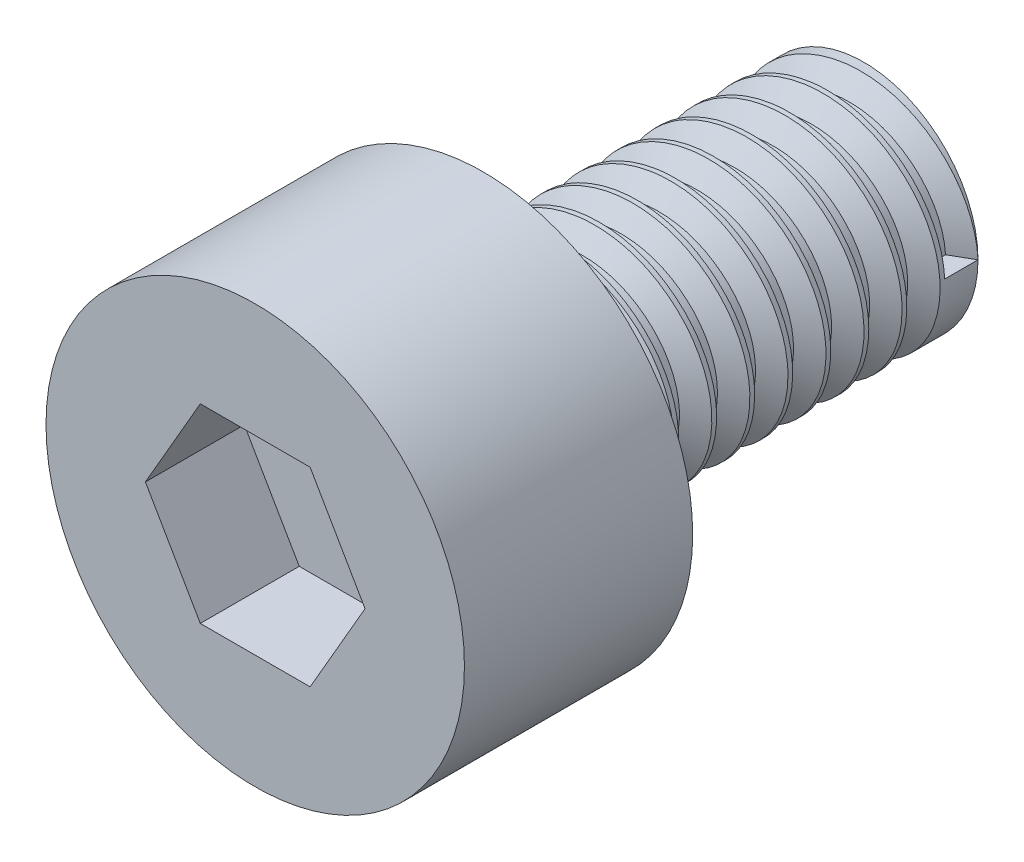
ISO-10303-21;
HEADER;
FILE_DESCRIPTION(('STEP AP214'),'2;1');
FILE_NAME('part.step','',(''),(''),'','','');
FILE_SCHEMA(('AUTOMOTIVE_DESIGN { 1 0 10303 214 1 1 1 1 }'));
ENDSEC;
DATA;
#1=APPLICATION_CONTEXT('core data for automotive mechanical design processes');
#2=APPLICATION_PROTOCOL_DEFINITION('international standard','automotive_design',2000,#1);
#3=PRODUCT_CONTEXT('',#1,'mechanical');
#4=PRODUCT('Part','Part','',(#3));
#5=PRODUCT_RELATED_PRODUCT_CATEGORY('part','',(#4));
#6=PRODUCT_DEFINITION_FORMATION('','',#4);
#7=PRODUCT_DEFINITION_CONTEXT('part definition',#1,'design');
#8=PRODUCT_DEFINITION('design','',#6,#7);
#9=PRODUCT_DEFINITION_SHAPE('','',#8);
#10=(LENGTH_UNIT() NAMED_UNIT(*) SI_UNIT(.MILLI.,.METRE.));
#11=(NAMED_UNIT(*) PLANE_ANGLE_UNIT() SI_UNIT($,.RADIAN.));
#12=(NAMED_UNIT(*) SI_UNIT($,.STERADIAN.) SOLID_ANGLE_UNIT());
#13=UNCERTAINTY_MEASURE_WITH_UNIT(LENGTH_MEASURE(1.E-05),#10,'distance_accuracy_value','');
#14=(GEOMETRIC_REPRESENTATION_CONTEXT(3) GLOBAL_UNCERTAINTY_ASSIGNED_CONTEXT((#13)) GLOBAL_UNIT_ASSIGNED_CONTEXT((#10,
#11,#12)) REPRESENTATION_CONTEXT('',''));
#15=CARTESIAN_POINT('',(0.,0.,0.));
#16=DIRECTION('',(0.,0.,1.));
#17=DIRECTION('',(1.,0.,0.));
#18=AXIS2_PLACEMENT_3D('',#15,#16,#17);
#19=CARTESIAN_POINT('',(0.,0.,-5.));
#20=DIRECTION('',(0.,0.,1.));
#21=DIRECTION('',(1.,0.,0.));
#22=AXIS2_PLACEMENT_3D('',#19,#20,#21);
#23=CYLINDRICAL_SURFACE('',#22,1.5);
#24=DIRECTION('',(0.,0.,1.));
#25=VECTOR('',#24,1.);
#26=CARTESIAN_POINT('',(1.5,0.,-4.7812500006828));
#27=LINE('',#26,#25);
#28=CARTESIAN_POINT('',(1.5,0.,-5.));
#29=VERTEX_POINT('',#28);
#30=CARTESIAN_POINT('',(1.5,0.,-4.56250000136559));
#31=VERTEX_POINT('',#30);
#32=EDGE_CURVE('E139',#29,#31,#27,.T.);
#33=ORIENTED_EDGE('',*,*,#32,.T.);
#34=CARTESIAN_POINT('',(1.5,0.,-4.56250000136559));
#35=CARTESIAN_POINT('',(1.5,0.866025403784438,-4.52083333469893));
#36=CARTESIAN_POINT('',(0.75,1.29903810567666,-4.47916666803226));
#37=CARTESIAN_POINT('',(0.,1.73205080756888,-4.43750000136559));
#38=CARTESIAN_POINT('',(-0.75,1.29903810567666,-4.39583333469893));
#39=CARTESIAN_POINT('',(-1.5,0.866025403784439,-4.35416666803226));
#40=CARTESIAN_POINT('',(-1.5,0.,-4.31250000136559));
#41=CARTESIAN_POINT('',(-1.5,-0.866025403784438,-4.27083333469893));
#42=CARTESIAN_POINT('',(-0.750000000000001,-1.29903810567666,-4.22916666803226));
#43=CARTESIAN_POINT('',(0.,-1.73205080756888,-4.18750000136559));
#44=CARTESIAN_POINT('',(0.749999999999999,-1.29903810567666,-4.14583333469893));
#45=CARTESIAN_POINT('',(1.5,-0.866025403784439,-4.10416666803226));
#46=CARTESIAN_POINT('',(1.5,0.,-4.06250000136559));
#47=CARTESIAN_POINT('',(1.5,0.866025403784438,-4.02083333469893));
#48=CARTESIAN_POINT('',(0.75,1.29903810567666,-3.97916666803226));
#49=CARTESIAN_POINT('',(0.,1.73205080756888,-3.93750000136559));
#50=CARTESIAN_POINT('',(-0.75,1.29903810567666,-3.89583333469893));
#51=CARTESIAN_POINT('',(-1.5,0.866025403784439,-3.85416666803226));
#52=CARTESIAN_POINT('',(-1.5,0.,-3.81250000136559));
#53=CARTESIAN_POINT('',(-1.5,-0.866025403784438,-3.77083333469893));
#54=CARTESIAN_POINT('',(-0.750000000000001,-1.29903810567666,-3.72916666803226));
#55=CARTESIAN_POINT('',(0.,-1.73205080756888,-3.68750000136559));
#56=CARTESIAN_POINT('',(0.749999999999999,-1.29903810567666,-3.64583333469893));
#57=CARTESIAN_POINT('',(1.5,-0.866025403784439,-3.60416666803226));
#58=CARTESIAN_POINT('',(1.5,0.,-3.56250000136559));
#59=CARTESIAN_POINT('',(1.5,0.866025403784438,-3.52083333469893));
#60=CARTESIAN_POINT('',(0.75,1.29903810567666,-3.47916666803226));
#61=CARTESIAN_POINT('',(0.,1.73205080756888,-3.43750000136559));
#62=CARTESIAN_POINT('',(-0.75,1.29903810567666,-3.39583333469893));
#63=CARTESIAN_POINT('',(-1.5,0.866025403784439,-3.35416666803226));
#64=CARTESIAN_POINT('',(-1.5,0.,-3.31250000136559));
#65=CARTESIAN_POINT('',(-1.5,-0.866025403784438,-3.27083333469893));
#66=CARTESIAN_POINT('',(-0.750000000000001,-1.29903810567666,-3.22916666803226));
#67=CARTESIAN_POINT('',(0.,-1.73205080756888,-3.18750000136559));
#68=CARTESIAN_POINT('',(0.749999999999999,-1.29903810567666,-3.14583333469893));
#69=CARTESIAN_POINT('',(1.5,-0.866025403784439,-3.10416666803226));
#70=CARTESIAN_POINT('',(1.5,0.,-3.06250000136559));
#71=CARTESIAN_POINT('',(1.5,0.866025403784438,-3.02083333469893));
#72=CARTESIAN_POINT('',(0.75,1.29903810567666,-2.97916666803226));
#73=CARTESIAN_POINT('',(0.,1.73205080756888,-2.93750000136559));
#74=CARTESIAN_POINT('',(-0.75,1.29903810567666,-2.89583333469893));
#75=CARTESIAN_POINT('',(-1.5,0.866025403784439,-2.85416666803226));
#76=CARTESIAN_POINT('',(-1.5,0.,-2.81250000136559));
#77=CARTESIAN_POINT('',(-1.5,-0.866025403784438,-2.77083333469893));
#78=CARTESIAN_POINT('',(-0.750000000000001,-1.29903810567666,-2.72916666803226));
#79=CARTESIAN_POINT('',(0.,-1.73205080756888,-2.68750000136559));
#80=CARTESIAN_POINT('',(0.749999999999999,-1.29903810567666,-2.64583333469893));
#81=CARTESIAN_POINT('',(1.5,-0.866025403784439,-2.60416666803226));
#82=CARTESIAN_POINT('',(1.5,0.,-2.56250000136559));
#83=CARTESIAN_POINT('',(1.5,0.866025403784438,-2.52083333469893));
#84=CARTESIAN_POINT('',(0.75,1.29903810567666,-2.47916666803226));
#85=CARTESIAN_POINT('',(0.,1.73205080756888,-2.43750000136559));
#86=CARTESIAN_POINT('',(-0.75,1.29903810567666,-2.39583333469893));
#87=CARTESIAN_POINT('',(-1.5,0.866025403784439,-2.35416666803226));
#88=CARTESIAN_POINT('',(-1.5,0.,-2.31250000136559));
#89=CARTESIAN_POINT('',(-1.5,-0.866025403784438,-2.27083333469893));
#90=CARTESIAN_POINT('',(-0.750000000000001,-1.29903810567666,-2.22916666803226));
#91=CARTESIAN_POINT('',(0.,-1.73205080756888,-2.18750000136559));
#92=CARTESIAN_POINT('',(0.749999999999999,-1.29903810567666,-2.14583333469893));
#93=CARTESIAN_POINT('',(1.5,-0.866025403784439,-2.10416666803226));
#94=CARTESIAN_POINT('',(1.5,0.,-2.06250000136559));
#95=CARTESIAN_POINT('',(1.5,0.866025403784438,-2.02083333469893));
#96=CARTESIAN_POINT('',(0.75,1.29903810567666,-1.97916666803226));
#97=CARTESIAN_POINT('',(0.,1.73205080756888,-1.93750000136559));
#98=CARTESIAN_POINT('',(-0.75,1.29903810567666,-1.89583333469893));
#99=CARTESIAN_POINT('',(-1.5,0.866025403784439,-1.85416666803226));
#100=CARTESIAN_POINT('',(-1.5,0.,-1.81250000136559));
#101=CARTESIAN_POINT('',(-1.5,-0.866025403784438,-1.77083333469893));
#102=CARTESIAN_POINT('',(-0.750000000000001,-1.29903810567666,-1.72916666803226));
#103=CARTESIAN_POINT('',(0.,-1.73205080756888,-1.68750000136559));
#104=CARTESIAN_POINT('',(0.749999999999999,-1.29903810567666,-1.64583333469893));
#105=CARTESIAN_POINT('',(1.5,-0.866025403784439,-1.60416666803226));
#106=CARTESIAN_POINT('',(1.5,0.,-1.56250000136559));
#107=CARTESIAN_POINT('',(1.5,0.866025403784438,-1.52083333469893));
#108=CARTESIAN_POINT('',(0.75,1.29903810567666,-1.47916666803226));
#109=CARTESIAN_POINT('',(0.,1.73205080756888,-1.43750000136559));
#110=CARTESIAN_POINT('',(-0.75,1.29903810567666,-1.39583333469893));
#111=CARTESIAN_POINT('',(-1.5,0.866025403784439,-1.35416666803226));
#112=CARTESIAN_POINT('',(-1.5,0.,-1.31250000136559));
#113=CARTESIAN_POINT('',(-1.5,-0.866025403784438,-1.27083333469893));
#114=CARTESIAN_POINT('',(-0.750000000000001,-1.29903810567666,-1.22916666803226));
#115=CARTESIAN_POINT('',(0.,-1.73205080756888,-1.18750000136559));
#116=CARTESIAN_POINT('',(0.749999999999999,-1.29903810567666,-1.14583333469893));
#117=CARTESIAN_POINT('',(1.5,-0.866025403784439,-1.10416666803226));
#118=CARTESIAN_POINT('',(1.5,0.,-1.06250000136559));
#119=CARTESIAN_POINT('',(1.5,0.866025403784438,-1.02083333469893));
#120=CARTESIAN_POINT('',(0.75,1.29903810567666,-0.97916666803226));
#121=CARTESIAN_POINT('',(0.,1.73205080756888,-0.937500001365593));
#122=CARTESIAN_POINT('',(-0.75,1.29903810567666,-0.895833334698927));
#123=CARTESIAN_POINT('',(-1.5,0.866025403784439,-0.85416666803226));
#124=CARTESIAN_POINT('',(-1.5,0.,-0.812500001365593));
#125=CARTESIAN_POINT('',(-1.5,-0.866025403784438,-0.770833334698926));
#126=CARTESIAN_POINT('',(-0.750000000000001,-1.29903810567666,-0.72916666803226));
#127=CARTESIAN_POINT('',(0.,-1.73205080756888,-0.687500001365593));
#128=CARTESIAN_POINT('',(0.749999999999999,-1.29903810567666,-0.645833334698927));
#129=CARTESIAN_POINT('',(1.5,-0.866025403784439,-0.60416666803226));
#130=CARTESIAN_POINT('',(1.5,0.,-0.562500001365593));
#131=CARTESIAN_POINT('',(1.5,0.866025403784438,-0.520833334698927));
#132=CARTESIAN_POINT('',(0.75,1.29903810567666,-0.47916666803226));
#133=CARTESIAN_POINT('',(0.,1.73205080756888,-0.437500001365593));
#134=CARTESIAN_POINT('',(-0.75,1.29903810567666,-0.395833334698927));
#135=CARTESIAN_POINT('',(-1.5,0.866025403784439,-0.35416666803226));
#136=CARTESIAN_POINT('',(-1.5,0.,-0.312500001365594));
#137=CARTESIAN_POINT('',(-1.5,-0.866025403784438,-0.270833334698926));
#138=CARTESIAN_POINT('',(-0.750000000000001,-1.29903810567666,-0.22916666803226));
#139=CARTESIAN_POINT('',(0.,-1.73205080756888,-0.187500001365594));
#140=CARTESIAN_POINT('',(0.749999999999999,-1.29903810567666,-0.145833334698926));
#141=CARTESIAN_POINT('',(1.5,-0.866025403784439,-0.10416666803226));
#142=CARTESIAN_POINT('',(1.5,0.,-0.0625000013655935));
#143=CARTESIAN_POINT('',(1.5,0.866025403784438,-0.0208333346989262));
#144=CARTESIAN_POINT('',(0.75,1.29903810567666,0.0208333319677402));
#145=CARTESIAN_POINT('',(0.,1.73205080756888,0.0624999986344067));
#146=CARTESIAN_POINT('',(-0.75,1.29903810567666,0.104166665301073));
#147=CARTESIAN_POINT('',(-1.5,0.866025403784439,0.14583333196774));
#148=CARTESIAN_POINT('',(-1.5,0.,0.187499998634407));
#149=CARTESIAN_POINT('',(-1.5,-0.866025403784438,0.229166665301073));
#150=CARTESIAN_POINT('',(-0.750000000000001,-1.29903810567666,0.27083333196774));
#151=CARTESIAN_POINT('',(0.,-1.73205080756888,0.312499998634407));
#152=CARTESIAN_POINT('',(0.749999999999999,-1.29903810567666,0.354166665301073));
#153=CARTESIAN_POINT('',(1.5,-0.866025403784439,0.39583333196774));
#154=CARTESIAN_POINT('',(1.5,0.,0.437499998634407));
#155=(BOUNDED_CURVE() B_SPLINE_CURVE(2,(#34,#35,#36,#37,#38,#39,#40,#41,#42,#43,#44,#45,#46,#47,
#48,#49,#50,#51,#52,#53,#54,#55,#56,#57,#58,#59,#60,#61,#62,#63,#64,#65,#66,#67,#68,#69,#70,#71,
#72,#73,#74,#75,#76,#77,#78,#79,#80,#81,#82,#83,#84,#85,#86,#87,#88,#89,#90,#91,#92,#93,#94,#95,
#96,#97,#98,#99,#100,#101,#102,#103,#104,#105,#106,#107,#108,#109,#110,#111,#112,#113,#114,#115,
#116,#117,#118,#119,#120,#121,#122,#123,#124,#125,#126,#127,#128,#129,#130,#131,#132,#133,#134,
#135,#136,#137,#138,#139,#140,#141,#142,#143,#144,#145,#146,#147,#148,#149,#150,#151,#152,#153,
#154),.UNSPECIFIED.,.F.,.F.) B_SPLINE_CURVE_WITH_KNOTS((3,2,2,2,2,2,2,2,2,2,2,2,2,2,2,2,2,2,2,2,
2,2,2,2,2,2,2,2,2,2,2,2,2,2,2,2,2,2,2,2,2,2,2,2,2,2,2,2,2,2,2,2,2,2,2,2,2,2,2,2,3),(0.,
0.0166666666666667,0.0333333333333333,0.05,0.0666666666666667,0.0833333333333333,0.1,
0.116666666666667,0.133333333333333,0.15,0.166666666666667,0.183333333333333,0.2,
0.216666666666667,0.233333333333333,0.25,0.266666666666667,0.283333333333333,0.3,
0.316666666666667,0.333333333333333,0.35,0.366666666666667,0.383333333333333,0.4,
0.416666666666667,0.433333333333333,0.45,0.466666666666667,0.483333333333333,0.5,
0.516666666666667,0.533333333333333,0.55,0.566666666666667,0.583333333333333,0.6,
0.616666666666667,0.633333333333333,0.65,0.666666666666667,0.683333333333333,0.7,
0.716666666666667,0.733333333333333,0.75,0.766666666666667,0.783333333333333,0.8,
0.816666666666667,0.833333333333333,0.85,0.866666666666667,0.883333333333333,0.9,
0.916666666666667,0.933333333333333,0.95,0.966666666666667,0.983333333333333,1.),
.UNSPECIFIED.) CURVE() GEOMETRIC_REPRESENTATION_ITEM() RATIONAL_B_SPLINE_CURVE((1.,
0.866025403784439,1.,0.866025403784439,1.,0.866025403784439,1.,0.866025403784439,1.,
0.866025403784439,1.,0.866025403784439,1.,0.866025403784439,1.,0.866025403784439,1.,
0.866025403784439,1.,0.866025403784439,1.,0.866025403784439,1.,0.866025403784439,1.,
0.866025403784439,1.,0.866025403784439,1.,0.866025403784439,1.,0.866025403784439,1.,
0.866025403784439,1.,0.866025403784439,1.,0.866025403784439,1.,0.866025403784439,1.,
0.866025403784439,1.,0.866025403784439,1.,0.866025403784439,1.,0.866025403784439,1.,
0.866025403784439,1.,0.866025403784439,1.,0.866025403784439,1.,0.866025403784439,1.,
0.866025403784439,1.,0.866025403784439,1.,0.866025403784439,1.,0.866025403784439,1.,
0.866025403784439,1.,0.866025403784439,1.,0.866025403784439,1.,0.866025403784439,1.,
0.866025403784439,1.,0.866025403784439,1.,0.866025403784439,1.,0.866025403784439,1.,
0.866025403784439,1.,0.866025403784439,1.,0.866025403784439,1.,0.866025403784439,1.,
0.866025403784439,1.,0.866025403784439,1.,0.866025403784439,1.,0.866025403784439,1.,
0.866025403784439,1.,0.866025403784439,1.,0.866025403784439,1.,0.866025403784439,1.,
0.866025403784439,1.,0.866025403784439,1.,0.866025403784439,1.,0.866025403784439,1.,
0.866025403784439,1.,0.866025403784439,1.,0.866025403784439,1.,0.866025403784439,1.)) REPRESENTATION_ITEM(''));
#156=CARTESIAN_POINT('',(1.07028821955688,1.0509439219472,0.));
#157=VERTEX_POINT('',#156);
#158=EDGE_CURVE('E118',#31,#157,#155,.T.);
#159=ORIENTED_EDGE('',*,*,#158,.T.);
#160=CARTESIAN_POINT('',(0.,0.,0.));
#161=DIRECTION('',(0.,0.,1.));
#162=DIRECTION('',(1.,0.,0.));
#163=AXIS2_PLACEMENT_3D('',#160,#161,#162);
#164=CIRCLE('',#163,1.5);
#165=CARTESIAN_POINT('',(1.5,0.,0.));
#166=VERTEX_POINT('',#165);
#167=EDGE_CURVE('E45',#166,#157,#164,.T.);
#168=ORIENTED_EDGE('',*,*,#167,.F.);
#169=CARTESIAN_POINT('',(1.5,0.,-5.));
#170=CARTESIAN_POINT('',(1.5,0.866025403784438,-4.95833333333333));
#171=CARTESIAN_POINT('',(0.75,1.29903810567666,-4.91666666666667));
#172=CARTESIAN_POINT('',(0.,1.73205080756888,-4.875));
#173=CARTESIAN_POINT('',(-0.75,1.29903810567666,-4.83333333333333));
#174=CARTESIAN_POINT('',(-1.5,0.866025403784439,-4.79166666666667));
#175=CARTESIAN_POINT('',(-1.5,0.,-4.75));
#176=CARTESIAN_POINT('',(-1.5,-0.866025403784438,-4.70833333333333));
#177=CARTESIAN_POINT('',(-0.750000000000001,-1.29903810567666,-4.66666666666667));
#178=CARTESIAN_POINT('',(0.,-1.73205080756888,-4.625));
#179=CARTESIAN_POINT('',(0.749999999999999,-1.29903810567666,-4.58333333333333));
#180=CARTESIAN_POINT('',(1.5,-0.866025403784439,-4.54166666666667));
#181=CARTESIAN_POINT('',(1.5,0.,-4.5));
#182=CARTESIAN_POINT('',(1.5,0.866025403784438,-4.45833333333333));
#183=CARTESIAN_POINT('',(0.75,1.29903810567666,-4.41666666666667));
#184=CARTESIAN_POINT('',(0.,1.73205080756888,-4.375));
#185=CARTESIAN_POINT('',(-0.75,1.29903810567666,-4.33333333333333));
#186=CARTESIAN_POINT('',(-1.5,0.866025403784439,-4.29166666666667));
#187=CARTESIAN_POINT('',(-1.5,0.,-4.25));
#188=CARTESIAN_POINT('',(-1.5,-0.866025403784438,-4.20833333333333));
#189=CARTESIAN_POINT('',(-0.750000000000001,-1.29903810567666,-4.16666666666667));
#190=CARTESIAN_POINT('',(0.,-1.73205080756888,-4.125));
#191=CARTESIAN_POINT('',(0.749999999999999,-1.29903810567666,-4.08333333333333));
#192=CARTESIAN_POINT('',(1.5,-0.866025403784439,-4.04166666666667));
#193=CARTESIAN_POINT('',(1.5,0.,-4.));
#194=CARTESIAN_POINT('',(1.5,0.866025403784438,-3.95833333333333));
#195=CARTESIAN_POINT('',(0.75,1.29903810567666,-3.91666666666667));
#196=CARTESIAN_POINT('',(0.,1.73205080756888,-3.875));
#197=CARTESIAN_POINT('',(-0.75,1.29903810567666,-3.83333333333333));
#198=CARTESIAN_POINT('',(-1.5,0.866025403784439,-3.79166666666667));
#199=CARTESIAN_POINT('',(-1.5,0.,-3.75));
#200=CARTESIAN_POINT('',(-1.5,-0.866025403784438,-3.70833333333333));
#201=CARTESIAN_POINT('',(-0.750000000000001,-1.29903810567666,-3.66666666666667));
#202=CARTESIAN_POINT('',(0.,-1.73205080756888,-3.625));
#203=CARTESIAN_POINT('',(0.749999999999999,-1.29903810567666,-3.58333333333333));
#204=CARTESIAN_POINT('',(1.5,-0.866025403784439,-3.54166666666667));
#205=CARTESIAN_POINT('',(1.5,0.,-3.5));
#206=CARTESIAN_POINT('',(1.5,0.866025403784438,-3.45833333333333));
#207=CARTESIAN_POINT('',(0.75,1.29903810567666,-3.41666666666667));
#208=CARTESIAN_POINT('',(0.,1.73205080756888,-3.375));
#209=CARTESIAN_POINT('',(-0.75,1.29903810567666,-3.33333333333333));
#210=CARTESIAN_POINT('',(-1.5,0.866025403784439,-3.29166666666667));
#211=CARTESIAN_POINT('',(-1.5,0.,-3.25));
#212=CARTESIAN_POINT('',(-1.5,-0.866025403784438,-3.20833333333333));
#213=CARTESIAN_POINT('',(-0.750000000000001,-1.29903810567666,-3.16666666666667));
#214=CARTESIAN_POINT('',(0.,-1.73205080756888,-3.125));
#215=CARTESIAN_POINT('',(0.749999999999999,-1.29903810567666,-3.08333333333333));
#216=CARTESIAN_POINT('',(1.5,-0.866025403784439,-3.04166666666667));
#217=CARTESIAN_POINT('',(1.5,0.,-3.));
#218=CARTESIAN_POINT('',(1.5,0.866025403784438,-2.95833333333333));
#219=CARTESIAN_POINT('',(0.75,1.29903810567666,-2.91666666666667));
#220=CARTESIAN_POINT('',(0.,1.73205080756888,-2.875));
#221=CARTESIAN_POINT('',(-0.75,1.29903810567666,-2.83333333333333));
#222=CARTESIAN_POINT('',(-1.5,0.866025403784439,-2.79166666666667));
#223=CARTESIAN_POINT('',(-1.5,0.,-2.75));
#224=CARTESIAN_POINT('',(-1.5,-0.866025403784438,-2.70833333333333));
#225=CARTESIAN_POINT('',(-0.750000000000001,-1.29903810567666,-2.66666666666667));
#226=CARTESIAN_POINT('',(0.,-1.73205080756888,-2.625));
#227=CARTESIAN_POINT('',(0.749999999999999,-1.29903810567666,-2.58333333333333));
#228=CARTESIAN_POINT('',(1.5,-0.866025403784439,-2.54166666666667));
#229=CARTESIAN_POINT('',(1.5,0.,-2.5));
#230=CARTESIAN_POINT('',(1.5,0.866025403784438,-2.45833333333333));
#231=CARTESIAN_POINT('',(0.75,1.29903810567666,-2.41666666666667));
#232=CARTESIAN_POINT('',(0.,1.73205080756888,-2.375));
#233=CARTESIAN_POINT('',(-0.75,1.29903810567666,-2.33333333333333));
#234=CARTESIAN_POINT('',(-1.5,0.866025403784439,-2.29166666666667));
#235=CARTESIAN_POINT('',(-1.5,0.,-2.25));
#236=CARTESIAN_POINT('',(-1.5,-0.866025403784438,-2.20833333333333));
#237=CARTESIAN_POINT('',(-0.750000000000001,-1.29903810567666,-2.16666666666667));
#238=CARTESIAN_POINT('',(0.,-1.73205080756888,-2.125));
#239=CARTESIAN_POINT('',(0.749999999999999,-1.29903810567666,-2.08333333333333));
#240=CARTESIAN_POINT('',(1.5,-0.866025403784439,-2.04166666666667));
#241=CARTESIAN_POINT('',(1.5,0.,-2.));
#242=CARTESIAN_POINT('',(1.5,0.866025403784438,-1.95833333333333));
#243=CARTESIAN_POINT('',(0.75,1.29903810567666,-1.91666666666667));
#244=CARTESIAN_POINT('',(0.,1.73205080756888,-1.875));
#245=CARTESIAN_POINT('',(-0.75,1.29903810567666,-1.83333333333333));
#246=CARTESIAN_POINT('',(-1.5,0.866025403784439,-1.79166666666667));
#247=CARTESIAN_POINT('',(-1.5,0.,-1.75));
#248=CARTESIAN_POINT('',(-1.5,-0.866025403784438,-1.70833333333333));
#249=CARTESIAN_POINT('',(-0.750000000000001,-1.29903810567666,-1.66666666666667));
#250=CARTESIAN_POINT('',(0.,-1.73205080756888,-1.625));
#251=CARTESIAN_POINT('',(0.749999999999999,-1.29903810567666,-1.58333333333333));
#252=CARTESIAN_POINT('',(1.5,-0.866025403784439,-1.54166666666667));
#253=CARTESIAN_POINT('',(1.5,0.,-1.5));
#254=CARTESIAN_POINT('',(1.5,0.866025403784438,-1.45833333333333));
#255=CARTESIAN_POINT('',(0.75,1.29903810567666,-1.41666666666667));
#256=CARTESIAN_POINT('',(0.,1.73205080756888,-1.375));
#257=CARTESIAN_POINT('',(-0.75,1.29903810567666,-1.33333333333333));
#258=CARTESIAN_POINT('',(-1.5,0.866025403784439,-1.29166666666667));
#259=CARTESIAN_POINT('',(-1.5,0.,-1.25));
#260=CARTESIAN_POINT('',(-1.5,-0.866025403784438,-1.20833333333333));
#261=CARTESIAN_POINT('',(-0.750000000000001,-1.29903810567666,-1.16666666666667));
#262=CARTESIAN_POINT('',(0.,-1.73205080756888,-1.125));
#263=CARTESIAN_POINT('',(0.749999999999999,-1.29903810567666,-1.08333333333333));
#264=CARTESIAN_POINT('',(1.5,-0.866025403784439,-1.04166666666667));
#265=CARTESIAN_POINT('',(1.5,0.,-1.));
#266=CARTESIAN_POINT('',(1.5,0.866025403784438,-0.958333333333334));
#267=CARTESIAN_POINT('',(0.75,1.29903810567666,-0.916666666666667));
#268=CARTESIAN_POINT('',(0.,1.73205080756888,-0.875));
#269=CARTESIAN_POINT('',(-0.75,1.29903810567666,-0.833333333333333));
#270=CARTESIAN_POINT('',(-1.5,0.866025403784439,-0.791666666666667));
#271=CARTESIAN_POINT('',(-1.5,0.,-0.750000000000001));
#272=CARTESIAN_POINT('',(-1.5,-0.866025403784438,-0.708333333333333));
#273=CARTESIAN_POINT('',(-0.750000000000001,-1.29903810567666,-0.666666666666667));
#274=CARTESIAN_POINT('',(0.,-1.73205080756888,-0.625000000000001));
#275=CARTESIAN_POINT('',(0.749999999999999,-1.29903810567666,-0.583333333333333));
#276=CARTESIAN_POINT('',(1.5,-0.866025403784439,-0.541666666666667));
#277=CARTESIAN_POINT('',(1.5,0.,-0.5));
#278=CARTESIAN_POINT('',(1.5,0.866025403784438,-0.458333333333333));
#279=CARTESIAN_POINT('',(0.75,1.29903810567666,-0.416666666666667));
#280=CARTESIAN_POINT('',(0.,1.73205080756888,-0.375));
#281=CARTESIAN_POINT('',(-0.75,1.29903810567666,-0.333333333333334));
#282=CARTESIAN_POINT('',(-1.5,0.866025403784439,-0.291666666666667));
#283=CARTESIAN_POINT('',(-1.5,0.,-0.25));
#284=CARTESIAN_POINT('',(-1.5,-0.866025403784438,-0.208333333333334));
#285=CARTESIAN_POINT('',(-0.750000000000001,-1.29903810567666,-0.166666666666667));
#286=CARTESIAN_POINT('',(0.,-1.73205080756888,-0.125));
#287=CARTESIAN_POINT('',(0.749999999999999,-1.29903810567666,-0.0833333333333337));
#288=CARTESIAN_POINT('',(1.5,-0.866025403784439,-0.0416666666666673));
#289=CARTESIAN_POINT('',(1.5,0.,0.));
#290=(BOUNDED_CURVE() B_SPLINE_CURVE(2,(#169,#170,#171,#172,#173,#174,#175,#176,#177,#178,#179,
#180,#181,#182,#183,#184,#185,#186,#187,#188,#189,#190,#191,#192,#193,#194,#195,#196,#197,#198,
#199,#200,#201,#202,#203,#204,#205,#206,#207,#208,#209,#210,#211,#212,#213,#214,#215,#216,#217,
#218,#219,#220,#221,#222,#223,#224,#225,#226,#227,#228,#229,#230,#231,#232,#233,#234,#235,#236,
#237,#238,#239,#240,#241,#242,#243,#244,#245,#246,#247,#248,#249,#250,#251,#252,#253,#254,#255,
#256,#257,#258,#259,#260,#261,#262,#263,#264,#265,#266,#267,#268,#269,#270,#271,#272,#273,#274,
#275,#276,#277,#278,#279,#280,#281,#282,#283,#284,#285,#286,#287,#288,#289),.UNSPECIFIED.,.F.,
.F.) B_SPLINE_CURVE_WITH_KNOTS((3,2,2,2,2,2,2,2,2,2,2,2,2,2,2,2,2,2,2,2,2,2,2,2,2,2,2,2,2,2,2,2,
2,2,2,2,2,2,2,2,2,2,2,2,2,2,2,2,2,2,2,2,2,2,2,2,2,2,2,2,3),(0.,0.0166666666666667,
0.0333333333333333,0.05,0.0666666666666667,0.0833333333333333,0.1,0.116666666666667,
0.133333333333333,0.15,0.166666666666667,0.183333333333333,0.2,0.216666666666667,
0.233333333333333,0.25,0.266666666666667,0.283333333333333,0.3,0.316666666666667,
0.333333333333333,0.35,0.366666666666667,0.383333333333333,0.4,0.416666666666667,
0.433333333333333,0.45,0.466666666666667,0.483333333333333,0.5,0.516666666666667,
0.533333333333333,0.55,0.566666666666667,0.583333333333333,0.6,0.616666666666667,
0.633333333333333,0.65,0.666666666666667,0.683333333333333,0.7,0.716666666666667,
0.733333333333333,0.75,0.766666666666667,0.783333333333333,0.8,0.816666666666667,
0.833333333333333,0.85,0.866666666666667,0.883333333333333,0.9,0.916666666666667,
0.933333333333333,0.95,0.966666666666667,0.983333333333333,1.),
.UNSPECIFIED.) CURVE() GEOMETRIC_REPRESENTATION_ITEM() RATIONAL_B_SPLINE_CURVE((1.,
0.866025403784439,1.,0.866025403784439,1.,0.866025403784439,1.,0.866025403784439,1.,
0.866025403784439,1.,0.866025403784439,1.,0.866025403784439,1.,0.866025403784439,1.,
0.866025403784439,1.,0.866025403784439,1.,0.866025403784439,1.,0.866025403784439,1.,
0.866025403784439,1.,0.866025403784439,1.,0.866025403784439,1.,0.866025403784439,1.,
0.866025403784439,1.,0.866025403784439,1.,0.866025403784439,1.,0.866025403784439,1.,
0.866025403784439,1.,0.866025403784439,1.,0.866025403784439,1.,0.866025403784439,1.,
0.866025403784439,1.,0.866025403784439,1.,0.866025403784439,1.,0.866025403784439,1.,
0.866025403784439,1.,0.866025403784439,1.,0.866025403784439,1.,0.866025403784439,1.,
0.866025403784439,1.,0.866025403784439,1.,0.866025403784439,1.,0.866025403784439,1.,
0.866025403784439,1.,0.866025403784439,1.,0.866025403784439,1.,0.866025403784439,1.,
0.866025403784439,1.,0.866025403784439,1.,0.866025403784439,1.,0.866025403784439,1.,
0.866025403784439,1.,0.866025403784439,1.,0.866025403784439,1.,0.866025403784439,1.,
0.866025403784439,1.,0.866025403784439,1.,0.866025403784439,1.,0.866025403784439,1.,
0.866025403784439,1.,0.866025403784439,1.,0.866025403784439,1.,0.866025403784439,1.,
0.866025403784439,1.,0.866025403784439,1.,0.866025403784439,1.,0.866025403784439,1.)) REPRESENTATION_ITEM(''));
#291=EDGE_CURVE('E132',#29,#166,#290,.T.);
#292=ORIENTED_EDGE('',*,*,#291,.F.);
#293=CARTESIAN_POINT('',(0.,0.,-5.));
#294=DIRECTION('',(0.,0.,1.));
#295=DIRECTION('',(1.,0.,0.));
#296=AXIS2_PLACEMENT_3D('',#293,#294,#295);
#297=CIRCLE('',#296,1.5);
#298=EDGE_CURVE('E11',#29,#29,#297,.T.);
#299=ORIENTED_EDGE('',*,*,#298,.T.);
#300=EDGE_LOOP('',(#33,#159,#168,#292,#299));
#301=FACE_BOUND('',#300,.T.);
#302=ADVANCED_FACE('F39',(#301),#23,.T.);
#303=CARTESIAN_POINT('',(0.,0.,-5.));
#304=DIRECTION('',(0.,0.,1.));
#305=DIRECTION('',(1.,0.,0.));
#306=AXIS2_PLACEMENT_3D('',#303,#304,#305);
#307=PLANE('',#306);
#308=ORIENTED_EDGE('',*,*,#298,.F.);
#309=EDGE_LOOP('',(#308));
#310=FACE_BOUND('',#309,.T.);
#311=ADVANCED_FACE('F222',(#310),#307,.F.);
#312=CARTESIAN_POINT('',(0.,0.,3.));
#313=DIRECTION('',(0.,0.,-1.));
#314=DIRECTION('',(-1.,0.,0.));
#315=AXIS2_PLACEMENT_3D('',#312,#313,#314);
#316=CYLINDRICAL_SURFACE('',#315,2.75);
#317=CARTESIAN_POINT('',(0.,0.,3.));
#318=DIRECTION('',(0.,0.,1.));
#319=DIRECTION('',(1.,0.,0.));
#320=AXIS2_PLACEMENT_3D('',#317,#318,#319);
#321=CIRCLE('',#320,2.75);
#322=CARTESIAN_POINT('',(2.75,0.,3.));
#323=VERTEX_POINT('',#322);
#324=EDGE_CURVE('E193',#323,#323,#321,.T.);
#325=ORIENTED_EDGE('',*,*,#324,.F.);
#326=EDGE_LOOP('',(#325));
#327=FACE_BOUND('',#326,.T.);
#328=CARTESIAN_POINT('',(0.,0.,0.));
#329=DIRECTION('',(0.,0.,1.));
#330=DIRECTION('',(1.,0.,0.));
#331=AXIS2_PLACEMENT_3D('',#328,#329,#330);
#332=CIRCLE('',#331,2.75);
#333=CARTESIAN_POINT('',(2.75,0.,0.));
#334=VERTEX_POINT('',#333);
#335=EDGE_CURVE('E184',#334,#334,#332,.T.);
#336=ORIENTED_EDGE('',*,*,#335,.T.);
#337=EDGE_LOOP('',(#336));
#338=FACE_BOUND('',#337,.T.);
#339=ADVANCED_FACE('F203',(#327,#338),#316,.T.);
#340=CARTESIAN_POINT('',(0.,0.,3.));
#341=DIRECTION('',(0.,0.,1.));
#342=DIRECTION('',(1.,0.,0.));
#343=AXIS2_PLACEMENT_3D('',#340,#341,#342);
#344=PLANE('',#343);
#345=DIRECTION('',(0.499999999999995,0.866025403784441,0.));
#346=VECTOR('',#345,1.);
#347=CARTESIAN_POINT('',(0.721687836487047,-1.24999999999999,3.));
#348=LINE('',#347,#346);
#349=CARTESIAN_POINT('',(0.721687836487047,-1.24999999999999,3.));
#350=VERTEX_POINT('',#349);
#351=CARTESIAN_POINT('',(1.44337567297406,0.,3.));
#352=VERTEX_POINT('',#351);
#353=EDGE_CURVE('E62',#350,#352,#348,.T.);
#354=ORIENTED_EDGE('',*,*,#353,.F.);
#355=DIRECTION('',(1.,0.,0.));
#356=VECTOR('',#355,1.);
#357=CARTESIAN_POINT('',(-0.721687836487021,-1.25000000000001,3.));
#358=LINE('',#357,#356);
#359=CARTESIAN_POINT('',(-0.721687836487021,-1.25000000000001,3.));
#360=VERTEX_POINT('',#359);
#361=EDGE_CURVE('E147',#360,#350,#358,.T.);
#362=ORIENTED_EDGE('',*,*,#361,.F.);
#363=DIRECTION('',(0.500000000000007,-0.866025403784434,0.));
#364=VECTOR('',#363,1.);
#365=CARTESIAN_POINT('',(-1.44337567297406,0.,3.));
#366=LINE('',#365,#364);
#367=CARTESIAN_POINT('',(-1.44337567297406,0.,3.));
#368=VERTEX_POINT('',#367);
#369=EDGE_CURVE('E176',#368,#360,#366,.T.);
#370=ORIENTED_EDGE('',*,*,#369,.F.);
#371=DIRECTION('',(-0.499999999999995,-0.866025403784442,0.));
#372=VECTOR('',#371,1.);
#373=CARTESIAN_POINT('',(-0.721687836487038,1.25,3.));
#374=LINE('',#373,#372);
#375=CARTESIAN_POINT('',(-0.721687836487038,1.25,3.));
#376=VERTEX_POINT('',#375);
#377=EDGE_CURVE('E171',#376,#368,#374,.T.);
#378=ORIENTED_EDGE('',*,*,#377,.F.);
#379=DIRECTION('',(-1.,0.,0.));
#380=VECTOR('',#379,1.);
#381=CARTESIAN_POINT('',(0.721687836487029,1.25,3.));
#382=LINE('',#381,#380);
#383=CARTESIAN_POINT('',(0.721687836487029,1.25,3.));
#384=VERTEX_POINT('',#383);
#385=EDGE_CURVE('E172',#384,#376,#382,.T.);
#386=ORIENTED_EDGE('',*,*,#385,.F.);
#387=DIRECTION('',(-0.500000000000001,0.866025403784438,0.));
#388=VECTOR('',#387,1.);
#389=CARTESIAN_POINT('',(1.44337567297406,0.,3.));
#390=LINE('',#389,#388);
#391=EDGE_CURVE('E170',#352,#384,#390,.T.);
#392=ORIENTED_EDGE('',*,*,#391,.F.);
#393=EDGE_LOOP('',(#354,#362,#370,#378,#386,#392));
#394=FACE_BOUND('',#393,.T.);
#395=ORIENTED_EDGE('',*,*,#324,.T.);
#396=EDGE_LOOP('',(#395));
#397=FACE_BOUND('',#396,.T.);
#398=ADVANCED_FACE('F206',(#394,#397),#344,.T.);
#399=CARTESIAN_POINT('',(0.,0.,0.));
#400=DIRECTION('',(0.,0.,1.));
#401=DIRECTION('',(1.,0.,0.));
#402=AXIS2_PLACEMENT_3D('',#399,#400,#401);
#403=PLANE('',#402);
#404=ORIENTED_EDGE('',*,*,#167,.T.);
#405=EDGE_CURVE('E197',#157,#166,#164,.T.);
#406=ORIENTED_EDGE('',*,*,#405,.T.);
#407=EDGE_LOOP('',(#404,#406));
#408=FACE_BOUND('',#407,.T.);
#409=ORIENTED_EDGE('',*,*,#335,.F.);
#410=EDGE_LOOP('',(#409));
#411=FACE_BOUND('',#410,.T.);
#412=ADVANCED_FACE('F201',(#408,#411),#403,.F.);
#413=CARTESIAN_POINT('',(0.721687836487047,-1.24999999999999,1.7));
#414=DIRECTION('',(0.866025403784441,-0.499999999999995,0.));
#415=DIRECTION('',(0.499999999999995,0.866025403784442,0.));
#416=AXIS2_PLACEMENT_3D('',#413,#414,#415);
#417=PLANE('',#416);
#418=ORIENTED_EDGE('',*,*,#353,.T.);
#419=DIRECTION('',(0.,0.,1.));
#420=VECTOR('',#419,1.);
#421=CARTESIAN_POINT('',(1.44337567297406,0.,1.7));
#422=LINE('',#421,#420);
#423=CARTESIAN_POINT('',(1.44337567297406,0.,1.7));
#424=VERTEX_POINT('',#423);
#425=EDGE_CURVE('E164',#424,#352,#422,.T.);
#426=ORIENTED_EDGE('',*,*,#425,.F.);
#427=DIRECTION('',(0.499999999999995,0.866025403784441,0.));
#428=VECTOR('',#427,1.);
#429=CARTESIAN_POINT('',(0.721687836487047,-1.24999999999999,1.7));
#430=LINE('',#429,#428);
#431=CARTESIAN_POINT('',(0.721687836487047,-1.24999999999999,1.7));
#432=VERTEX_POINT('',#431);
#433=EDGE_CURVE('E148',#432,#424,#430,.T.);
#434=ORIENTED_EDGE('',*,*,#433,.F.);
#435=DIRECTION('',(0.,0.,1.));
#436=VECTOR('',#435,1.);
#437=CARTESIAN_POINT('',(0.721687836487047,-1.24999999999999,1.7));
#438=LINE('',#437,#436);
#439=EDGE_CURVE('E185',#432,#350,#438,.T.);
#440=ORIENTED_EDGE('',*,*,#439,.T.);
#441=EDGE_LOOP('',(#418,#426,#434,#440));
#442=FACE_BOUND('',#441,.T.);
#443=ADVANCED_FACE('F202',(#442),#417,.F.);
#444=CARTESIAN_POINT('',(-0.721687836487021,-1.25000000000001,1.7));
#445=DIRECTION('',(0.,-1.,0.));
#446=DIRECTION('',(1.,0.,0.));
#447=AXIS2_PLACEMENT_3D('',#444,#445,#446);
#448=PLANE('',#447);
#449=ORIENTED_EDGE('',*,*,#361,.T.);
#450=ORIENTED_EDGE('',*,*,#439,.F.);
#451=DIRECTION('',(1.,0.,0.));
#452=VECTOR('',#451,1.);
#453=CARTESIAN_POINT('',(-0.721687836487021,-1.25000000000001,1.7));
#454=LINE('',#453,#452);
#455=CARTESIAN_POINT('',(-0.721687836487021,-1.25000000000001,1.7));
#456=VERTEX_POINT('',#455);
#457=EDGE_CURVE('E165',#456,#432,#454,.T.);
#458=ORIENTED_EDGE('',*,*,#457,.F.);
#459=DIRECTION('',(0.,0.,1.));
#460=VECTOR('',#459,1.);
#461=CARTESIAN_POINT('',(-0.721687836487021,-1.25000000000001,1.7));
#462=LINE('',#461,#460);
#463=EDGE_CURVE('E183',#456,#360,#462,.T.);
#464=ORIENTED_EDGE('',*,*,#463,.T.);
#465=EDGE_LOOP('',(#449,#450,#458,#464));
#466=FACE_BOUND('',#465,.T.);
#467=ADVANCED_FACE('F212',(#466),#448,.F.);
#468=CARTESIAN_POINT('',(-1.44337567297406,0.,1.7));
#469=DIRECTION('',(-0.866025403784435,-0.500000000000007,0.));
#470=DIRECTION('',(0.500000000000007,-0.866025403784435,0.));
#471=AXIS2_PLACEMENT_3D('',#468,#469,#470);
#472=PLANE('',#471);
#473=ORIENTED_EDGE('',*,*,#369,.T.);
#474=ORIENTED_EDGE('',*,*,#463,.F.);
#475=DIRECTION('',(0.500000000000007,-0.866025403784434,0.));
#476=VECTOR('',#475,1.);
#477=CARTESIAN_POINT('',(-1.44337567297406,0.,1.7));
#478=LINE('',#477,#476);
#479=CARTESIAN_POINT('',(-1.44337567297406,0.,1.7));
#480=VERTEX_POINT('',#479);
#481=EDGE_CURVE('E157',#480,#456,#478,.T.);
#482=ORIENTED_EDGE('',*,*,#481,.F.);
#483=DIRECTION('',(0.,0.,1.));
#484=VECTOR('',#483,1.);
#485=CARTESIAN_POINT('',(-1.44337567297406,0.,1.7));
#486=LINE('',#485,#484);
#487=EDGE_CURVE('E189',#480,#368,#486,.T.);
#488=ORIENTED_EDGE('',*,*,#487,.T.);
#489=EDGE_LOOP('',(#473,#474,#482,#488));
#490=FACE_BOUND('',#489,.T.);
#491=ADVANCED_FACE('F253',(#490),#472,.F.);
#492=CARTESIAN_POINT('',(-0.721687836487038,1.25,1.7));
#493=DIRECTION('',(-0.866025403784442,0.499999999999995,0.));
#494=DIRECTION('',(-0.499999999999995,-0.866025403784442,0.));
#495=AXIS2_PLACEMENT_3D('',#492,#493,#494);
#496=PLANE('',#495);
#497=ORIENTED_EDGE('',*,*,#377,.T.);
#498=ORIENTED_EDGE('',*,*,#487,.F.);
#499=DIRECTION('',(-0.499999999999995,-0.866025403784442,0.));
#500=VECTOR('',#499,1.);
#501=CARTESIAN_POINT('',(-0.721687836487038,1.25,1.7));
#502=LINE('',#501,#500);
#503=CARTESIAN_POINT('',(-0.721687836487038,1.25,1.7));
#504=VERTEX_POINT('',#503);
#505=EDGE_CURVE('E156',#504,#480,#502,.T.);
#506=ORIENTED_EDGE('',*,*,#505,.F.);
#507=DIRECTION('',(0.,0.,1.));
#508=VECTOR('',#507,1.);
#509=CARTESIAN_POINT('',(-0.721687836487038,1.25,1.7));
#510=LINE('',#509,#508);
#511=EDGE_CURVE('E186',#504,#376,#510,.T.);
#512=ORIENTED_EDGE('',*,*,#511,.T.);
#513=EDGE_LOOP('',(#497,#498,#506,#512));
#514=FACE_BOUND('',#513,.T.);
#515=ADVANCED_FACE('F257',(#514),#496,.F.);
#516=CARTESIAN_POINT('',(0.721687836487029,1.25,1.7));
#517=DIRECTION('',(0.,1.,0.));
#518=DIRECTION('',(-1.,0.,0.));
#519=AXIS2_PLACEMENT_3D('',#516,#517,#518);
#520=PLANE('',#519);
#521=ORIENTED_EDGE('',*,*,#385,.T.);
#522=ORIENTED_EDGE('',*,*,#511,.F.);
#523=DIRECTION('',(-1.,0.,0.));
#524=VECTOR('',#523,1.);
#525=CARTESIAN_POINT('',(0.721687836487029,1.25,1.7));
#526=LINE('',#525,#524);
#527=CARTESIAN_POINT('',(0.721687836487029,1.25,1.7));
#528=VERTEX_POINT('',#527);
#529=EDGE_CURVE('E153',#528,#504,#526,.T.);
#530=ORIENTED_EDGE('',*,*,#529,.F.);
#531=DIRECTION('',(0.,0.,1.));
#532=VECTOR('',#531,1.);
#533=CARTESIAN_POINT('',(0.721687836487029,1.25,1.7));
#534=LINE('',#533,#532);
#535=EDGE_CURVE('E194',#528,#384,#534,.T.);
#536=ORIENTED_EDGE('',*,*,#535,.T.);
#537=EDGE_LOOP('',(#521,#522,#530,#536));
#538=FACE_BOUND('',#537,.T.);
#539=ADVANCED_FACE('F267',(#538),#520,.F.);
#540=CARTESIAN_POINT('',(1.44337567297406,0.,1.7));
#541=DIRECTION('',(0.866025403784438,0.500000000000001,0.));
#542=DIRECTION('',(-0.500000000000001,0.866025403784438,0.));
#543=AXIS2_PLACEMENT_3D('',#540,#541,#542);
#544=PLANE('',#543);
#545=ORIENTED_EDGE('',*,*,#391,.T.);
#546=ORIENTED_EDGE('',*,*,#535,.F.);
#547=DIRECTION('',(-0.500000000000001,0.866025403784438,0.));
#548=VECTOR('',#547,1.);
#549=CARTESIAN_POINT('',(1.44337567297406,0.,1.7));
#550=LINE('',#549,#548);
#551=EDGE_CURVE('E149',#424,#528,#550,.T.);
#552=ORIENTED_EDGE('',*,*,#551,.F.);
#553=ORIENTED_EDGE('',*,*,#425,.T.);
#554=EDGE_LOOP('',(#545,#546,#552,#553));
#555=FACE_BOUND('',#554,.T.);
#556=ADVANCED_FACE('F279',(#555),#544,.F.);
#557=CARTESIAN_POINT('',(0.,0.,1.7));
#558=DIRECTION('',(0.,0.,1.));
#559=DIRECTION('',(1.,0.,0.));
#560=AXIS2_PLACEMENT_3D('',#557,#558,#559);
#561=PLANE('',#560);
#562=ORIENTED_EDGE('',*,*,#433,.T.);
#563=ORIENTED_EDGE('',*,*,#551,.T.);
#564=ORIENTED_EDGE('',*,*,#529,.T.);
#565=ORIENTED_EDGE('',*,*,#505,.T.);
#566=ORIENTED_EDGE('',*,*,#481,.T.);
#567=ORIENTED_EDGE('',*,*,#457,.T.);
#568=EDGE_LOOP('',(#562,#563,#564,#565,#566,#567));
#569=FACE_BOUND('',#568,.T.);
#570=ADVANCED_FACE('F289',(#569),#561,.T.);
#571=CARTESIAN_POINT('',(0.,0.,-5.));
#572=DIRECTION('',(0.,0.,1.));
#573=DIRECTION('',(1.,0.,0.));
#574=AXIS2_PLACEMENT_3D('',#571,#572,#573);
#575=CYLINDRICAL_SURFACE('',#574,1.5);
#576=CARTESIAN_POINT('',(1.5,0.,0.437499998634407));
#577=VERTEX_POINT('',#576);
#578=EDGE_CURVE('E127',#157,#577,#155,.T.);
#579=ORIENTED_EDGE('',*,*,#578,.T.);
#580=DIRECTION('',(0.,0.,-1.));
#581=VECTOR('',#580,1.);
#582=CARTESIAN_POINT('',(1.5,0.,0.218749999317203));
#583=LINE('',#582,#581);
#584=EDGE_CURVE('E142',#577,#166,#583,.T.);
#585=ORIENTED_EDGE('',*,*,#584,.T.);
#586=ORIENTED_EDGE('',*,*,#405,.F.);
#587=EDGE_LOOP('',(#579,#585,#586));
#588=FACE_BOUND('',#587,.T.);
#589=ADVANCED_FACE('F294',(#588),#575,.F.);
#590=CARTESIAN_POINT('',(1.36468353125,0.,-4.9218750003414));
#591=DIRECTION('',(0.,-1.,0.));
#592=DIRECTION('',(0.,0.,-1.));
#593=AXIS2_PLACEMENT_3D('',#590,#591,#592);
#594=PLANE('',#593);
#595=DIRECTION('',(0.86602540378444,0.,-0.499999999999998));
#596=VECTOR('',#595,1.);
#597=CARTESIAN_POINT('',(1.36468353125,0.,-4.9218750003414));
#598=LINE('',#597,#596);
#599=CARTESIAN_POINT('',(1.2293670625,0.,-4.8437500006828));
#600=VERTEX_POINT('',#599);
#601=EDGE_CURVE('E52',#600,#29,#598,.T.);
#602=ORIENTED_EDGE('',*,*,#601,.F.);
#603=DIRECTION('',(0.,0.,-1.));
#604=VECTOR('',#603,1.);
#605=CARTESIAN_POINT('',(1.2293670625,0.,-4.7812500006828));
#606=LINE('',#605,#604);
#607=CARTESIAN_POINT('',(1.2293670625,0.,-4.7187500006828));
#608=VERTEX_POINT('',#607);
#609=EDGE_CURVE('E140',#608,#600,#606,.T.);
#610=ORIENTED_EDGE('',*,*,#609,.F.);
#611=DIRECTION('',(-0.86602540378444,0.,-0.499999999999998));
#612=VECTOR('',#611,1.);
#613=CARTESIAN_POINT('',(1.36468353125,0.,-4.64062500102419));
#614=LINE('',#613,#612);
#615=EDGE_CURVE('E125',#31,#608,#614,.T.);
#616=ORIENTED_EDGE('',*,*,#615,.F.);
#617=ORIENTED_EDGE('',*,*,#32,.F.);
#618=EDGE_LOOP('',(#602,#610,#616,#617));
#619=FACE_BOUND('',#618,.T.);
#620=ADVANCED_FACE('F133',(#619),#594,.F.);
#621=CARTESIAN_POINT('',(1.36468353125,0.,0.0781249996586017));
#622=DIRECTION('',(0.,1.,0.));
#623=DIRECTION('',(0.,0.,1.));
#624=AXIS2_PLACEMENT_3D('',#621,#622,#623);
#625=PLANE('',#624);
#626=DIRECTION('',(-0.86602540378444,0.,0.499999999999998));
#627=VECTOR('',#626,1.);
#628=CARTESIAN_POINT('',(1.36468353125,0.,0.0781249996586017));
#629=LINE('',#628,#627);
#630=CARTESIAN_POINT('',(1.2293670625,0.,0.156249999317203));
#631=VERTEX_POINT('',#630);
#632=EDGE_CURVE('E169',#166,#631,#629,.T.);
#633=ORIENTED_EDGE('',*,*,#632,.F.);
#634=ORIENTED_EDGE('',*,*,#584,.F.);
#635=DIRECTION('',(0.86602540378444,0.,0.499999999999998));
#636=VECTOR('',#635,1.);
#637=CARTESIAN_POINT('',(1.36468353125,0.,0.359374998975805));
#638=LINE('',#637,#636);
#639=CARTESIAN_POINT('',(1.2293670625,0.,0.281249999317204));
#640=VERTEX_POINT('',#639);
#641=EDGE_CURVE('E384',#640,#577,#638,.T.);
#642=ORIENTED_EDGE('',*,*,#641,.F.);
#643=DIRECTION('',(0.,0.,1.));
#644=VECTOR('',#643,1.);
#645=CARTESIAN_POINT('',(1.2293670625,0.,0.218749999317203));
#646=LINE('',#645,#644);
#647=EDGE_CURVE('E386',#631,#640,#646,.T.);
#648=ORIENTED_EDGE('',*,*,#647,.F.);
#649=EDGE_LOOP('',(#633,#634,#642,#648));
#650=FACE_BOUND('',#649,.T.);
#651=ADVANCED_FACE('F317',(#650),#625,.F.);
#652=CARTESIAN_POINT('',(1.2293670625,0.,-4.8437500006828));
#653=CARTESIAN_POINT('',(1.2293670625,0.709775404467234,-4.80208333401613));
#654=CARTESIAN_POINT('',(0.61468353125,1.06466310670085,-4.76041666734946));
#655=CARTESIAN_POINT('',(0.,1.41955080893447,-4.7187500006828));
#656=CARTESIAN_POINT('',(-0.61468353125,1.06466310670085,-4.67708333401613));
#657=CARTESIAN_POINT('',(-1.2293670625,0.709775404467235,-4.63541666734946));
#658=CARTESIAN_POINT('',(-1.2293670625,0.,-4.5937500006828));
#659=CARTESIAN_POINT('',(-1.2293670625,-0.709775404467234,-4.55208333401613));
#660=CARTESIAN_POINT('',(-0.614683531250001,-1.06466310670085,-4.51041666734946));
#661=CARTESIAN_POINT('',(0.,-1.41955080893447,-4.4687500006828));
#662=CARTESIAN_POINT('',(0.614683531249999,-1.06466310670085,-4.42708333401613));
#663=CARTESIAN_POINT('',(1.2293670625,-0.709775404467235,-4.38541666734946));
#664=CARTESIAN_POINT('',(1.2293670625,0.,-4.3437500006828));
#665=CARTESIAN_POINT('',(1.2293670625,0.709775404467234,-4.30208333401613));
#666=CARTESIAN_POINT('',(0.61468353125,1.06466310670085,-4.26041666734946));
#667=CARTESIAN_POINT('',(0.,1.41955080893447,-4.2187500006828));
#668=CARTESIAN_POINT('',(-0.61468353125,1.06466310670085,-4.17708333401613));
#669=CARTESIAN_POINT('',(-1.2293670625,0.709775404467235,-4.13541666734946));
#670=CARTESIAN_POINT('',(-1.2293670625,0.,-4.0937500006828));
#671=CARTESIAN_POINT('',(-1.2293670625,-0.709775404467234,-4.05208333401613));
#672=CARTESIAN_POINT('',(-0.614683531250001,-1.06466310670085,-4.01041666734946));
#673=CARTESIAN_POINT('',(0.,-1.41955080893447,-3.9687500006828));
#674=CARTESIAN_POINT('',(0.614683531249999,-1.06466310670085,-3.92708333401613));
#675=CARTESIAN_POINT('',(1.2293670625,-0.709775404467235,-3.88541666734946));
#676=CARTESIAN_POINT('',(1.2293670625,0.,-3.8437500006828));
#677=CARTESIAN_POINT('',(1.2293670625,0.709775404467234,-3.80208333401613));
#678=CARTESIAN_POINT('',(0.61468353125,1.06466310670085,-3.76041666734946));
#679=CARTESIAN_POINT('',(0.,1.41955080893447,-3.7187500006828));
#680=CARTESIAN_POINT('',(-0.61468353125,1.06466310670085,-3.67708333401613));
#681=CARTESIAN_POINT('',(-1.2293670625,0.709775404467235,-3.63541666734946));
#682=CARTESIAN_POINT('',(-1.2293670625,0.,-3.5937500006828));
#683=CARTESIAN_POINT('',(-1.2293670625,-0.709775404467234,-3.55208333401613));
#684=CARTESIAN_POINT('',(-0.614683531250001,-1.06466310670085,-3.51041666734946));
#685=CARTESIAN_POINT('',(0.,-1.41955080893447,-3.4687500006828));
#686=CARTESIAN_POINT('',(0.614683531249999,-1.06466310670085,-3.42708333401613));
#687=CARTESIAN_POINT('',(1.2293670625,-0.709775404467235,-3.38541666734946));
#688=CARTESIAN_POINT('',(1.2293670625,0.,-3.3437500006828));
#689=CARTESIAN_POINT('',(1.2293670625,0.709775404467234,-3.30208333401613));
#690=CARTESIAN_POINT('',(0.61468353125,1.06466310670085,-3.26041666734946));
#691=CARTESIAN_POINT('',(0.,1.41955080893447,-3.2187500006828));
#692=CARTESIAN_POINT('',(-0.61468353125,1.06466310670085,-3.17708333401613));
#693=CARTESIAN_POINT('',(-1.2293670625,0.709775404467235,-3.13541666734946));
#694=CARTESIAN_POINT('',(-1.2293670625,0.,-3.0937500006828));
#695=CARTESIAN_POINT('',(-1.2293670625,-0.709775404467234,-3.05208333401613));
#696=CARTESIAN_POINT('',(-0.614683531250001,-1.06466310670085,-3.01041666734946));
#697=CARTESIAN_POINT('',(0.,-1.41955080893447,-2.9687500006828));
#698=CARTESIAN_POINT('',(0.614683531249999,-1.06466310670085,-2.92708333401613));
#699=CARTESIAN_POINT('',(1.2293670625,-0.709775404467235,-2.88541666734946));
#700=CARTESIAN_POINT('',(1.2293670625,0.,-2.8437500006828));
#701=CARTESIAN_POINT('',(1.2293670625,0.709775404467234,-2.80208333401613));
#702=CARTESIAN_POINT('',(0.61468353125,1.06466310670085,-2.76041666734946));
#703=CARTESIAN_POINT('',(0.,1.41955080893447,-2.7187500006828));
#704=CARTESIAN_POINT('',(-0.61468353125,1.06466310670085,-2.67708333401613));
#705=CARTESIAN_POINT('',(-1.2293670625,0.709775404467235,-2.63541666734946));
#706=CARTESIAN_POINT('',(-1.2293670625,0.,-2.5937500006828));
#707=CARTESIAN_POINT('',(-1.2293670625,-0.709775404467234,-2.55208333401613));
#708=CARTESIAN_POINT('',(-0.614683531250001,-1.06466310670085,-2.51041666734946));
#709=CARTESIAN_POINT('',(0.,-1.41955080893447,-2.4687500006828));
#710=CARTESIAN_POINT('',(0.614683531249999,-1.06466310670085,-2.42708333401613));
#711=CARTESIAN_POINT('',(1.2293670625,-0.709775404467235,-2.38541666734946));
#712=CARTESIAN_POINT('',(1.2293670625,0.,-2.3437500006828));
#713=CARTESIAN_POINT('',(1.2293670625,0.709775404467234,-2.30208333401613));
#714=CARTESIAN_POINT('',(0.61468353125,1.06466310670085,-2.26041666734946));
#715=CARTESIAN_POINT('',(0.,1.41955080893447,-2.2187500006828));
#716=CARTESIAN_POINT('',(-0.61468353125,1.06466310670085,-2.17708333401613));
#717=CARTESIAN_POINT('',(-1.2293670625,0.709775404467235,-2.13541666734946));
#718=CARTESIAN_POINT('',(-1.2293670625,0.,-2.0937500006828));
#719=CARTESIAN_POINT('',(-1.2293670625,-0.709775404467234,-2.05208333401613));
#720=CARTESIAN_POINT('',(-0.614683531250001,-1.06466310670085,-2.01041666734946));
#721=CARTESIAN_POINT('',(0.,-1.41955080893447,-1.9687500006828));
#722=CARTESIAN_POINT('',(0.614683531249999,-1.06466310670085,-1.92708333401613));
#723=CARTESIAN_POINT('',(1.2293670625,-0.709775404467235,-1.88541666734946));
#724=CARTESIAN_POINT('',(1.2293670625,0.,-1.8437500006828));
#725=CARTESIAN_POINT('',(1.2293670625,0.709775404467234,-1.80208333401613));
#726=CARTESIAN_POINT('',(0.61468353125,1.06466310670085,-1.76041666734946));
#727=CARTESIAN_POINT('',(0.,1.41955080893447,-1.7187500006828));
#728=CARTESIAN_POINT('',(-0.61468353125,1.06466310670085,-1.67708333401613));
#729=CARTESIAN_POINT('',(-1.2293670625,0.709775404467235,-1.63541666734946));
#730=CARTESIAN_POINT('',(-1.2293670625,0.,-1.5937500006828));
#731=CARTESIAN_POINT('',(-1.2293670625,-0.709775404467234,-1.55208333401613));
#732=CARTESIAN_POINT('',(-0.614683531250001,-1.06466310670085,-1.51041666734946));
#733=CARTESIAN_POINT('',(0.,-1.41955080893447,-1.4687500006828));
#734=CARTESIAN_POINT('',(0.614683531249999,-1.06466310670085,-1.42708333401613));
#735=CARTESIAN_POINT('',(1.2293670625,-0.709775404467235,-1.38541666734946));
#736=CARTESIAN_POINT('',(1.2293670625,0.,-1.3437500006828));
#737=CARTESIAN_POINT('',(1.2293670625,0.709775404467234,-1.30208333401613));
#738=CARTESIAN_POINT('',(0.61468353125,1.06466310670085,-1.26041666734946));
#739=CARTESIAN_POINT('',(0.,1.41955080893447,-1.2187500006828));
#740=CARTESIAN_POINT('',(-0.61468353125,1.06466310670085,-1.17708333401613));
#741=CARTESIAN_POINT('',(-1.2293670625,0.709775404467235,-1.13541666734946));
#742=CARTESIAN_POINT('',(-1.2293670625,0.,-1.0937500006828));
#743=CARTESIAN_POINT('',(-1.2293670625,-0.709775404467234,-1.05208333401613));
#744=CARTESIAN_POINT('',(-0.614683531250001,-1.06466310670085,-1.01041666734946));
#745=CARTESIAN_POINT('',(0.,-1.41955080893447,-0.968750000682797));
#746=CARTESIAN_POINT('',(0.614683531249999,-1.06466310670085,-0.92708333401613));
#747=CARTESIAN_POINT('',(1.2293670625,-0.709775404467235,-0.885416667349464));
#748=CARTESIAN_POINT('',(1.2293670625,0.,-0.843750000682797));
#749=CARTESIAN_POINT('',(1.2293670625,0.709775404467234,-0.80208333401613));
#750=CARTESIAN_POINT('',(0.61468353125,1.06466310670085,-0.760416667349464));
#751=CARTESIAN_POINT('',(0.,1.41955080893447,-0.718750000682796));
#752=CARTESIAN_POINT('',(-0.61468353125,1.06466310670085,-0.67708333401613));
#753=CARTESIAN_POINT('',(-1.2293670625,0.709775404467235,-0.635416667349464));
#754=CARTESIAN_POINT('',(-1.2293670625,0.,-0.593750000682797));
#755=CARTESIAN_POINT('',(-1.2293670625,-0.709775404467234,-0.55208333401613));
#756=CARTESIAN_POINT('',(-0.614683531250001,-1.06466310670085,-0.510416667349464));
#757=CARTESIAN_POINT('',(0.,-1.41955080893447,-0.468750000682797));
#758=CARTESIAN_POINT('',(0.614683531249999,-1.06466310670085,-0.42708333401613));
#759=CARTESIAN_POINT('',(1.2293670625,-0.709775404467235,-0.385416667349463));
#760=CARTESIAN_POINT('',(1.2293670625,0.,-0.343750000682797));
#761=CARTESIAN_POINT('',(1.2293670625,0.709775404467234,-0.30208333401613));
#762=CARTESIAN_POINT('',(0.61468353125,1.06466310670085,-0.260416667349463));
#763=CARTESIAN_POINT('',(0.,1.41955080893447,-0.218750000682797));
#764=CARTESIAN_POINT('',(-0.61468353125,1.06466310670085,-0.17708333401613));
#765=CARTESIAN_POINT('',(-1.2293670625,0.709775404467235,-0.135416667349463));
#766=CARTESIAN_POINT('',(-1.2293670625,0.,-0.0937500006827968));
#767=CARTESIAN_POINT('',(-1.2293670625,-0.709775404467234,-0.0520833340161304));
#768=CARTESIAN_POINT('',(-0.614683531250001,-1.06466310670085,-0.0104166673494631));
#769=CARTESIAN_POINT('',(0.,-1.41955080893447,0.0312499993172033));
#770=CARTESIAN_POINT('',(0.614683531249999,-1.06466310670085,0.0729166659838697));
#771=CARTESIAN_POINT('',(1.2293670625,-0.709775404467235,0.114583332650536));
#772=CARTESIAN_POINT('',(1.2293670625,0.,0.156249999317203));
#773=CARTESIAN_POINT('',(1.5,0.,-5.));
#774=CARTESIAN_POINT('',(1.5,0.866025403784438,-4.95833333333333));
#775=CARTESIAN_POINT('',(0.75,1.29903810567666,-4.91666666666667));
#776=CARTESIAN_POINT('',(0.,1.73205080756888,-4.875));
#777=CARTESIAN_POINT('',(-0.75,1.29903810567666,-4.83333333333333));
#778=CARTESIAN_POINT('',(-1.5,0.866025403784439,-4.79166666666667));
#779=CARTESIAN_POINT('',(-1.5,0.,-4.75));
#780=CARTESIAN_POINT('',(-1.5,-0.866025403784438,-4.70833333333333));
#781=CARTESIAN_POINT('',(-0.750000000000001,-1.29903810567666,-4.66666666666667));
#782=CARTESIAN_POINT('',(0.,-1.73205080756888,-4.625));
#783=CARTESIAN_POINT('',(0.749999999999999,-1.29903810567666,-4.58333333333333));
#784=CARTESIAN_POINT('',(1.5,-0.866025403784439,-4.54166666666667));
#785=CARTESIAN_POINT('',(1.5,0.,-4.5));
#786=CARTESIAN_POINT('',(1.5,0.866025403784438,-4.45833333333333));
#787=CARTESIAN_POINT('',(0.75,1.29903810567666,-4.41666666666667));
#788=CARTESIAN_POINT('',(0.,1.73205080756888,-4.375));
#789=CARTESIAN_POINT('',(-0.75,1.29903810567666,-4.33333333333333));
#790=CARTESIAN_POINT('',(-1.5,0.866025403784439,-4.29166666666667));
#791=CARTESIAN_POINT('',(-1.5,0.,-4.25));
#792=CARTESIAN_POINT('',(-1.5,-0.866025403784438,-4.20833333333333));
#793=CARTESIAN_POINT('',(-0.750000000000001,-1.29903810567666,-4.16666666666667));
#794=CARTESIAN_POINT('',(0.,-1.73205080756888,-4.125));
#795=CARTESIAN_POINT('',(0.749999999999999,-1.29903810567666,-4.08333333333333));
#796=CARTESIAN_POINT('',(1.5,-0.866025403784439,-4.04166666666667));
#797=CARTESIAN_POINT('',(1.5,0.,-4.));
#798=CARTESIAN_POINT('',(1.5,0.866025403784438,-3.95833333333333));
#799=CARTESIAN_POINT('',(0.75,1.29903810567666,-3.91666666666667));
#800=CARTESIAN_POINT('',(0.,1.73205080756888,-3.875));
#801=CARTESIAN_POINT('',(-0.75,1.29903810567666,-3.83333333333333));
#802=CARTESIAN_POINT('',(-1.5,0.866025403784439,-3.79166666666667));
#803=CARTESIAN_POINT('',(-1.5,0.,-3.75));
#804=CARTESIAN_POINT('',(-1.5,-0.866025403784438,-3.70833333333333));
#805=CARTESIAN_POINT('',(-0.750000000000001,-1.29903810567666,-3.66666666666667));
#806=CARTESIAN_POINT('',(0.,-1.73205080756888,-3.625));
#807=CARTESIAN_POINT('',(0.749999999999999,-1.29903810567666,-3.58333333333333));
#808=CARTESIAN_POINT('',(1.5,-0.866025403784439,-3.54166666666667));
#809=CARTESIAN_POINT('',(1.5,0.,-3.5));
#810=CARTESIAN_POINT('',(1.5,0.866025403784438,-3.45833333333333));
#811=CARTESIAN_POINT('',(0.75,1.29903810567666,-3.41666666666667));
#812=CARTESIAN_POINT('',(0.,1.73205080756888,-3.375));
#813=CARTESIAN_POINT('',(-0.75,1.29903810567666,-3.33333333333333));
#814=CARTESIAN_POINT('',(-1.5,0.866025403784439,-3.29166666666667));
#815=CARTESIAN_POINT('',(-1.5,0.,-3.25));
#816=CARTESIAN_POINT('',(-1.5,-0.866025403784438,-3.20833333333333));
#817=CARTESIAN_POINT('',(-0.750000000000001,-1.29903810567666,-3.16666666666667));
#818=CARTESIAN_POINT('',(0.,-1.73205080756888,-3.125));
#819=CARTESIAN_POINT('',(0.749999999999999,-1.29903810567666,-3.08333333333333));
#820=CARTESIAN_POINT('',(1.5,-0.866025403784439,-3.04166666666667));
#821=CARTESIAN_POINT('',(1.5,0.,-3.));
#822=CARTESIAN_POINT('',(1.5,0.866025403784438,-2.95833333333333));
#823=CARTESIAN_POINT('',(0.75,1.29903810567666,-2.91666666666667));
#824=CARTESIAN_POINT('',(0.,1.73205080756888,-2.875));
#825=CARTESIAN_POINT('',(-0.75,1.29903810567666,-2.83333333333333));
#826=CARTESIAN_POINT('',(-1.5,0.866025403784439,-2.79166666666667));
#827=CARTESIAN_POINT('',(-1.5,0.,-2.75));
#828=CARTESIAN_POINT('',(-1.5,-0.866025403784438,-2.70833333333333));
#829=CARTESIAN_POINT('',(-0.750000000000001,-1.29903810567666,-2.66666666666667));
#830=CARTESIAN_POINT('',(0.,-1.73205080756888,-2.625));
#831=CARTESIAN_POINT('',(0.749999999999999,-1.29903810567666,-2.58333333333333));
#832=CARTESIAN_POINT('',(1.5,-0.866025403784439,-2.54166666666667));
#833=CARTESIAN_POINT('',(1.5,0.,-2.5));
#834=CARTESIAN_POINT('',(1.5,0.866025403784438,-2.45833333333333));
#835=CARTESIAN_POINT('',(0.75,1.29903810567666,-2.41666666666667));
#836=CARTESIAN_POINT('',(0.,1.73205080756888,-2.375));
#837=CARTESIAN_POINT('',(-0.75,1.29903810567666,-2.33333333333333));
#838=CARTESIAN_POINT('',(-1.5,0.866025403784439,-2.29166666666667));
#839=CARTESIAN_POINT('',(-1.5,0.,-2.25));
#840=CARTESIAN_POINT('',(-1.5,-0.866025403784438,-2.20833333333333));
#841=CARTESIAN_POINT('',(-0.750000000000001,-1.29903810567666,-2.16666666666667));
#842=CARTESIAN_POINT('',(0.,-1.73205080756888,-2.125));
#843=CARTESIAN_POINT('',(0.749999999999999,-1.29903810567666,-2.08333333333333));
#844=CARTESIAN_POINT('',(1.5,-0.866025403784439,-2.04166666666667));
#845=CARTESIAN_POINT('',(1.5,0.,-2.));
#846=CARTESIAN_POINT('',(1.5,0.866025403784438,-1.95833333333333));
#847=CARTESIAN_POINT('',(0.75,1.29903810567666,-1.91666666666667));
#848=CARTESIAN_POINT('',(0.,1.73205080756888,-1.875));
#849=CARTESIAN_POINT('',(-0.75,1.29903810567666,-1.83333333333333));
#850=CARTESIAN_POINT('',(-1.5,0.866025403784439,-1.79166666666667));
#851=CARTESIAN_POINT('',(-1.5,0.,-1.75));
#852=CARTESIAN_POINT('',(-1.5,-0.866025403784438,-1.70833333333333));
#853=CARTESIAN_POINT('',(-0.750000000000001,-1.29903810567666,-1.66666666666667));
#854=CARTESIAN_POINT('',(0.,-1.73205080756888,-1.625));
#855=CARTESIAN_POINT('',(0.749999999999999,-1.29903810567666,-1.58333333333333));
#856=CARTESIAN_POINT('',(1.5,-0.866025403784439,-1.54166666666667));
#857=CARTESIAN_POINT('',(1.5,0.,-1.5));
#858=CARTESIAN_POINT('',(1.5,0.866025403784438,-1.45833333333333));
#859=CARTESIAN_POINT('',(0.75,1.29903810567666,-1.41666666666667));
#860=CARTESIAN_POINT('',(0.,1.73205080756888,-1.375));
#861=CARTESIAN_POINT('',(-0.75,1.29903810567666,-1.33333333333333));
#862=CARTESIAN_POINT('',(-1.5,0.866025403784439,-1.29166666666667));
#863=CARTESIAN_POINT('',(-1.5,0.,-1.25));
#864=CARTESIAN_POINT('',(-1.5,-0.866025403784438,-1.20833333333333));
#865=CARTESIAN_POINT('',(-0.750000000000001,-1.29903810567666,-1.16666666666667));
#866=CARTESIAN_POINT('',(0.,-1.73205080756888,-1.125));
#867=CARTESIAN_POINT('',(0.749999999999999,-1.29903810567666,-1.08333333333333));
#868=CARTESIAN_POINT('',(1.5,-0.866025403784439,-1.04166666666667));
#869=CARTESIAN_POINT('',(1.5,0.,-1.));
#870=CARTESIAN_POINT('',(1.5,0.866025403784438,-0.958333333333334));
#871=CARTESIAN_POINT('',(0.75,1.29903810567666,-0.916666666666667));
#872=CARTESIAN_POINT('',(0.,1.73205080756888,-0.875));
#873=CARTESIAN_POINT('',(-0.75,1.29903810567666,-0.833333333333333));
#874=CARTESIAN_POINT('',(-1.5,0.866025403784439,-0.791666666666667));
#875=CARTESIAN_POINT('',(-1.5,0.,-0.750000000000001));
#876=CARTESIAN_POINT('',(-1.5,-0.866025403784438,-0.708333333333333));
#877=CARTESIAN_POINT('',(-0.750000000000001,-1.29903810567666,-0.666666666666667));
#878=CARTESIAN_POINT('',(0.,-1.73205080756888,-0.625000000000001));
#879=CARTESIAN_POINT('',(0.749999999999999,-1.29903810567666,-0.583333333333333));
#880=CARTESIAN_POINT('',(1.5,-0.866025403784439,-0.541666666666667));
#881=CARTESIAN_POINT('',(1.5,0.,-0.5));
#882=CARTESIAN_POINT('',(1.5,0.866025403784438,-0.458333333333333));
#883=CARTESIAN_POINT('',(0.75,1.29903810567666,-0.416666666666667));
#884=CARTESIAN_POINT('',(0.,1.73205080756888,-0.375));
#885=CARTESIAN_POINT('',(-0.75,1.29903810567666,-0.333333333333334));
#886=CARTESIAN_POINT('',(-1.5,0.866025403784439,-0.291666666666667));
#887=CARTESIAN_POINT('',(-1.5,0.,-0.25));
#888=CARTESIAN_POINT('',(-1.5,-0.866025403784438,-0.208333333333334));
#889=CARTESIAN_POINT('',(-0.750000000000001,-1.29903810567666,-0.166666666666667));
#890=CARTESIAN_POINT('',(0.,-1.73205080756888,-0.125));
#891=CARTESIAN_POINT('',(0.749999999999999,-1.29903810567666,-0.0833333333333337));
#892=CARTESIAN_POINT('',(1.5,-0.866025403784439,-0.0416666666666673));
#893=CARTESIAN_POINT('',(1.5,0.,0.));
#894=(BOUNDED_SURFACE() B_SPLINE_SURFACE(1,2,((#652,#653,#654,#655,#656,#657,#658,#659,#660,
#661,#662,#663,#664,#665,#666,#667,#668,#669,#670,#671,#672,#673,#674,#675,#676,#677,#678,#679,
#680,#681,#682,#683,#684,#685,#686,#687,#688,#689,#690,#691,#692,#693,#694,#695,#696,#697,#698,
#699,#700,#701,#702,#703,#704,#705,#706,#707,#708,#709,#710,#711,#712,#713,#714,#715,#716,#717,
#718,#719,#720,#721,#722,#723,#724,#725,#726,#727,#728,#729,#730,#731,#732,#733,#734,#735,#736,
#737,#738,#739,#740,#741,#742,#743,#744,#745,#746,#747,#748,#749,#750,#751,#752,#753,#754,#755,
#756,#757,#758,#759,#760,#761,#762,#763,#764,#765,#766,#767,#768,#769,#770,#771,#772),(#773,
#774,#775,#776,#777,#778,#779,#780,#781,#782,#783,#784,#785,#786,#787,#788,#789,#790,#791,#792,
#793,#794,#795,#796,#797,#798,#799,#800,#801,#802,#803,#804,#805,#806,#807,#808,#809,#810,#811,
#812,#813,#814,#815,#816,#817,#818,#819,#820,#821,#822,#823,#824,#825,#826,#827,#828,#829,#830,
#831,#832,#833,#834,#835,#836,#837,#838,#839,#840,#841,#842,#843,#844,#845,#846,#847,#848,#849,
#850,#851,#852,#853,#854,#855,#856,#857,#858,#859,#860,#861,#862,#863,#864,#865,#866,#867,#868,
#869,#870,#871,#872,#873,#874,#875,#876,#877,#878,#879,#880,#881,#882,#883,#884,#885,#886,#887,
#888,#889,#890,#891,#892,#893)),.UNSPECIFIED.,.F.,.F.,.F.) B_SPLINE_SURFACE_WITH_KNOTS((2,2),(3,
2,2,2,2,2,2,2,2,2,2,2,2,2,2,2,2,2,2,2,2,2,2,2,2,2,2,2,2,2,2,2,2,2,2,2,2,2,2,2,2,2,2,2,2,2,2,2,2,
2,2,2,2,2,2,2,2,2,2,2,3),(0.,1.),(0.,0.0166666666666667,0.0333333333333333,0.05,
0.0666666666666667,0.0833333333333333,0.1,0.116666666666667,0.133333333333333,0.15,
0.166666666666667,0.183333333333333,0.2,0.216666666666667,0.233333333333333,0.25,
0.266666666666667,0.283333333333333,0.3,0.316666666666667,0.333333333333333,0.35,
0.366666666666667,0.383333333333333,0.4,0.416666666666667,0.433333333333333,0.45,
0.466666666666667,0.483333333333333,0.5,0.516666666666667,0.533333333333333,0.55,
0.566666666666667,0.583333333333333,0.6,0.616666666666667,0.633333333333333,0.65,
0.666666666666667,0.683333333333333,0.7,0.716666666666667,0.733333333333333,0.75,
0.766666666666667,0.783333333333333,0.8,0.816666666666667,0.833333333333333,0.85,
0.866666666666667,0.883333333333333,0.9,0.916666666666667,0.933333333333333,0.95,
0.966666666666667,0.983333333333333,1.),
.UNSPECIFIED.) GEOMETRIC_REPRESENTATION_ITEM() RATIONAL_B_SPLINE_SURFACE(((1.,0.866025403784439,
1.,0.866025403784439,1.,0.866025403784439,1.,0.866025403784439,1.,0.866025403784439,1.,
0.866025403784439,1.,0.866025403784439,1.,0.866025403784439,1.,0.866025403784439,1.,
0.866025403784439,1.,0.866025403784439,1.,0.866025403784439,1.,0.866025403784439,1.,
0.866025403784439,1.,0.866025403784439,1.,0.866025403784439,1.,0.866025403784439,1.,
0.866025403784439,1.,0.866025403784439,1.,0.866025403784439,1.,0.866025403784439,1.,
0.866025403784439,1.,0.866025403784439,1.,0.866025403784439,1.,0.866025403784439,1.,
0.866025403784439,1.,0.866025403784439,1.,0.866025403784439,1.,0.866025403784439,1.,
0.866025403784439,1.,0.866025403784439,1.,0.866025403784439,1.,0.866025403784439,1.,
0.866025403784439,1.,0.866025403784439,1.,0.866025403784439,1.,0.866025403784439,1.,
0.866025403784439,1.,0.866025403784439,1.,0.866025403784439,1.,0.866025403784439,1.,
0.866025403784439,1.,0.866025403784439,1.,0.866025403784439,1.,0.866025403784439,1.,
0.866025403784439,1.,0.866025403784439,1.,0.866025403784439,1.,0.866025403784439,1.,
0.866025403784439,1.,0.866025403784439,1.,0.866025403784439,1.,0.866025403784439,1.,
0.866025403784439,1.,0.866025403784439,1.,0.866025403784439,1.,0.866025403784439,1.,
0.866025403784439,1.,0.866025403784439,1.,0.866025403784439,1.),(1.,0.866025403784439,1.,
0.866025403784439,1.,0.866025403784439,1.,0.866025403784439,1.,0.866025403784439,1.,
0.866025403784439,1.,0.866025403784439,1.,0.866025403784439,1.,0.866025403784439,1.,
0.866025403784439,1.,0.866025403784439,1.,0.866025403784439,1.,0.866025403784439,1.,
0.866025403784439,1.,0.866025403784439,1.,0.866025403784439,1.,0.866025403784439,1.,
0.866025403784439,1.,0.866025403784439,1.,0.866025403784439,1.,0.866025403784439,1.,
0.866025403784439,1.,0.866025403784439,1.,0.866025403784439,1.,0.866025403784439,1.,
0.866025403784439,1.,0.866025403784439,1.,0.866025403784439,1.,0.866025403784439,1.,
0.866025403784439,1.,0.866025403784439,1.,0.866025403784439,1.,0.866025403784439,1.,
0.866025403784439,1.,0.866025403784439,1.,0.866025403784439,1.,0.866025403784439,1.,
0.866025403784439,1.,0.866025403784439,1.,0.866025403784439,1.,0.866025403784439,1.,
0.866025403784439,1.,0.866025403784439,1.,0.866025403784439,1.,0.866025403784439,1.,
0.866025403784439,1.,0.866025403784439,1.,0.866025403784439,1.,0.866025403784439,1.,
0.866025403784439,1.,0.866025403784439,1.,0.866025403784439,1.,0.866025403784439,1.,
0.866025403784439,1.,0.866025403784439,1.,0.866025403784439,1.,0.866025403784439,1.,
0.866025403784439,1.,0.866025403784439,1.,0.866025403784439,1.))) REPRESENTATION_ITEM('') SURFACE());
#895=CARTESIAN_POINT('',(1.2293670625,0.,-4.8437500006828));
#896=CARTESIAN_POINT('',(1.2293670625,0.709775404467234,-4.80208333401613));
#897=CARTESIAN_POINT('',(0.61468353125,1.06466310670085,-4.76041666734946));
#898=CARTESIAN_POINT('',(0.,1.41955080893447,-4.7187500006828));
#899=CARTESIAN_POINT('',(-0.61468353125,1.06466310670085,-4.67708333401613));
#900=CARTESIAN_POINT('',(-1.2293670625,0.709775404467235,-4.63541666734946));
#901=CARTESIAN_POINT('',(-1.2293670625,0.,-4.5937500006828));
#902=CARTESIAN_POINT('',(-1.2293670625,-0.709775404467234,-4.55208333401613));
#903=CARTESIAN_POINT('',(-0.614683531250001,-1.06466310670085,-4.51041666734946));
#904=CARTESIAN_POINT('',(0.,-1.41955080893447,-4.4687500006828));
#905=CARTESIAN_POINT('',(0.614683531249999,-1.06466310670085,-4.42708333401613));
#906=CARTESIAN_POINT('',(1.2293670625,-0.709775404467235,-4.38541666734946));
#907=CARTESIAN_POINT('',(1.2293670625,0.,-4.3437500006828));
#908=CARTESIAN_POINT('',(1.2293670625,0.709775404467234,-4.30208333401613));
#909=CARTESIAN_POINT('',(0.61468353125,1.06466310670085,-4.26041666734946));
#910=CARTESIAN_POINT('',(0.,1.41955080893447,-4.2187500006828));
#911=CARTESIAN_POINT('',(-0.61468353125,1.06466310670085,-4.17708333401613));
#912=CARTESIAN_POINT('',(-1.2293670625,0.709775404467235,-4.13541666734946));
#913=CARTESIAN_POINT('',(-1.2293670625,0.,-4.0937500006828));
#914=CARTESIAN_POINT('',(-1.2293670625,-0.709775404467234,-4.05208333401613));
#915=CARTESIAN_POINT('',(-0.614683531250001,-1.06466310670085,-4.01041666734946));
#916=CARTESIAN_POINT('',(0.,-1.41955080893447,-3.9687500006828));
#917=CARTESIAN_POINT('',(0.614683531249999,-1.06466310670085,-3.92708333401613));
#918=CARTESIAN_POINT('',(1.2293670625,-0.709775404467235,-3.88541666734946));
#919=CARTESIAN_POINT('',(1.2293670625,0.,-3.8437500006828));
#920=CARTESIAN_POINT('',(1.2293670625,0.709775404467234,-3.80208333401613));
#921=CARTESIAN_POINT('',(0.61468353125,1.06466310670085,-3.76041666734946));
#922=CARTESIAN_POINT('',(0.,1.41955080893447,-3.7187500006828));
#923=CARTESIAN_POINT('',(-0.61468353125,1.06466310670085,-3.67708333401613));
#924=CARTESIAN_POINT('',(-1.2293670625,0.709775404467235,-3.63541666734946));
#925=CARTESIAN_POINT('',(-1.2293670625,0.,-3.5937500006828));
#926=CARTESIAN_POINT('',(-1.2293670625,-0.709775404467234,-3.55208333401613));
#927=CARTESIAN_POINT('',(-0.614683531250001,-1.06466310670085,-3.51041666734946));
#928=CARTESIAN_POINT('',(0.,-1.41955080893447,-3.4687500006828));
#929=CARTESIAN_POINT('',(0.614683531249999,-1.06466310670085,-3.42708333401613));
#930=CARTESIAN_POINT('',(1.2293670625,-0.709775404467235,-3.38541666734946));
#931=CARTESIAN_POINT('',(1.2293670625,0.,-3.3437500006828));
#932=CARTESIAN_POINT('',(1.2293670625,0.709775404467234,-3.30208333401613));
#933=CARTESIAN_POINT('',(0.61468353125,1.06466310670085,-3.26041666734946));
#934=CARTESIAN_POINT('',(0.,1.41955080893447,-3.2187500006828));
#935=CARTESIAN_POINT('',(-0.61468353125,1.06466310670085,-3.17708333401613));
#936=CARTESIAN_POINT('',(-1.2293670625,0.709775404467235,-3.13541666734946));
#937=CARTESIAN_POINT('',(-1.2293670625,0.,-3.0937500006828));
#938=CARTESIAN_POINT('',(-1.2293670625,-0.709775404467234,-3.05208333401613));
#939=CARTESIAN_POINT('',(-0.614683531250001,-1.06466310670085,-3.01041666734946));
#940=CARTESIAN_POINT('',(0.,-1.41955080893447,-2.9687500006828));
#941=CARTESIAN_POINT('',(0.614683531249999,-1.06466310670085,-2.92708333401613));
#942=CARTESIAN_POINT('',(1.2293670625,-0.709775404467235,-2.88541666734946));
#943=CARTESIAN_POINT('',(1.2293670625,0.,-2.8437500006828));
#944=CARTESIAN_POINT('',(1.2293670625,0.709775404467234,-2.80208333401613));
#945=CARTESIAN_POINT('',(0.61468353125,1.06466310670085,-2.76041666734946));
#946=CARTESIAN_POINT('',(0.,1.41955080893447,-2.7187500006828));
#947=CARTESIAN_POINT('',(-0.61468353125,1.06466310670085,-2.67708333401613));
#948=CARTESIAN_POINT('',(-1.2293670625,0.709775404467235,-2.63541666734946));
#949=CARTESIAN_POINT('',(-1.2293670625,0.,-2.5937500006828));
#950=CARTESIAN_POINT('',(-1.2293670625,-0.709775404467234,-2.55208333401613));
#951=CARTESIAN_POINT('',(-0.614683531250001,-1.06466310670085,-2.51041666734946));
#952=CARTESIAN_POINT('',(0.,-1.41955080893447,-2.4687500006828));
#953=CARTESIAN_POINT('',(0.614683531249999,-1.06466310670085,-2.42708333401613));
#954=CARTESIAN_POINT('',(1.2293670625,-0.709775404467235,-2.38541666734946));
#955=CARTESIAN_POINT('',(1.2293670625,0.,-2.3437500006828));
#956=CARTESIAN_POINT('',(1.2293670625,0.709775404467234,-2.30208333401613));
#957=CARTESIAN_POINT('',(0.61468353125,1.06466310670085,-2.26041666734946));
#958=CARTESIAN_POINT('',(0.,1.41955080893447,-2.2187500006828));
#959=CARTESIAN_POINT('',(-0.61468353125,1.06466310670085,-2.17708333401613));
#960=CARTESIAN_POINT('',(-1.2293670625,0.709775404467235,-2.13541666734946));
#961=CARTESIAN_POINT('',(-1.2293670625,0.,-2.0937500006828));
#962=CARTESIAN_POINT('',(-1.2293670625,-0.709775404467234,-2.05208333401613));
#963=CARTESIAN_POINT('',(-0.614683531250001,-1.06466310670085,-2.01041666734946));
#964=CARTESIAN_POINT('',(0.,-1.41955080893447,-1.9687500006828));
#965=CARTESIAN_POINT('',(0.614683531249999,-1.06466310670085,-1.92708333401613));
#966=CARTESIAN_POINT('',(1.2293670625,-0.709775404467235,-1.88541666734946));
#967=CARTESIAN_POINT('',(1.2293670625,0.,-1.8437500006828));
#968=CARTESIAN_POINT('',(1.2293670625,0.709775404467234,-1.80208333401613));
#969=CARTESIAN_POINT('',(0.61468353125,1.06466310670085,-1.76041666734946));
#970=CARTESIAN_POINT('',(0.,1.41955080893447,-1.7187500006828));
#971=CARTESIAN_POINT('',(-0.61468353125,1.06466310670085,-1.67708333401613));
#972=CARTESIAN_POINT('',(-1.2293670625,0.709775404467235,-1.63541666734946));
#973=CARTESIAN_POINT('',(-1.2293670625,0.,-1.5937500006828));
#974=CARTESIAN_POINT('',(-1.2293670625,-0.709775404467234,-1.55208333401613));
#975=CARTESIAN_POINT('',(-0.614683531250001,-1.06466310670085,-1.51041666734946));
#976=CARTESIAN_POINT('',(0.,-1.41955080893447,-1.4687500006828));
#977=CARTESIAN_POINT('',(0.614683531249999,-1.06466310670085,-1.42708333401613));
#978=CARTESIAN_POINT('',(1.2293670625,-0.709775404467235,-1.38541666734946));
#979=CARTESIAN_POINT('',(1.2293670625,0.,-1.3437500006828));
#980=CARTESIAN_POINT('',(1.2293670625,0.709775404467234,-1.30208333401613));
#981=CARTESIAN_POINT('',(0.61468353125,1.06466310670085,-1.26041666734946));
#982=CARTESIAN_POINT('',(0.,1.41955080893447,-1.2187500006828));
#983=CARTESIAN_POINT('',(-0.61468353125,1.06466310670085,-1.17708333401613));
#984=CARTESIAN_POINT('',(-1.2293670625,0.709775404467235,-1.13541666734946));
#985=CARTESIAN_POINT('',(-1.2293670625,0.,-1.0937500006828));
#986=CARTESIAN_POINT('',(-1.2293670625,-0.709775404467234,-1.05208333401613));
#987=CARTESIAN_POINT('',(-0.614683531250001,-1.06466310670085,-1.01041666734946));
#988=CARTESIAN_POINT('',(0.,-1.41955080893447,-0.968750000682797));
#989=CARTESIAN_POINT('',(0.614683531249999,-1.06466310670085,-0.92708333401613));
#990=CARTESIAN_POINT('',(1.2293670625,-0.709775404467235,-0.885416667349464));
#991=CARTESIAN_POINT('',(1.2293670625,0.,-0.843750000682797));
#992=CARTESIAN_POINT('',(1.2293670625,0.709775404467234,-0.80208333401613));
#993=CARTESIAN_POINT('',(0.61468353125,1.06466310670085,-0.760416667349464));
#994=CARTESIAN_POINT('',(0.,1.41955080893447,-0.718750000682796));
#995=CARTESIAN_POINT('',(-0.61468353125,1.06466310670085,-0.67708333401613));
#996=CARTESIAN_POINT('',(-1.2293670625,0.709775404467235,-0.635416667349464));
#997=CARTESIAN_POINT('',(-1.2293670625,0.,-0.593750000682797));
#998=CARTESIAN_POINT('',(-1.2293670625,-0.709775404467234,-0.55208333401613));
#999=CARTESIAN_POINT('',(-0.614683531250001,-1.06466310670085,-0.510416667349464));
#1000=CARTESIAN_POINT('',(0.,-1.41955080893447,-0.468750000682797));
#1001=CARTESIAN_POINT('',(0.614683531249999,-1.06466310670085,-0.42708333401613));
#1002=CARTESIAN_POINT('',(1.2293670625,-0.709775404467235,-0.385416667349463));
#1003=CARTESIAN_POINT('',(1.2293670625,0.,-0.343750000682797));
#1004=CARTESIAN_POINT('',(1.2293670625,0.709775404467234,-0.30208333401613));
#1005=CARTESIAN_POINT('',(0.61468353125,1.06466310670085,-0.260416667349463));
#1006=CARTESIAN_POINT('',(0.,1.41955080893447,-0.218750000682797));
#1007=CARTESIAN_POINT('',(-0.61468353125,1.06466310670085,-0.17708333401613));
#1008=CARTESIAN_POINT('',(-1.2293670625,0.709775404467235,-0.135416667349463));
#1009=CARTESIAN_POINT('',(-1.2293670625,0.,-0.0937500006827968));
#1010=CARTESIAN_POINT('',(-1.2293670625,-0.709775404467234,-0.0520833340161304));
#1011=CARTESIAN_POINT('',(-0.614683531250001,-1.06466310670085,-0.0104166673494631));
#1012=CARTESIAN_POINT('',(0.,-1.41955080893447,0.0312499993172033));
#1013=CARTESIAN_POINT('',(0.614683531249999,-1.06466310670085,0.0729166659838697));
#1014=CARTESIAN_POINT('',(1.2293670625,-0.709775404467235,0.114583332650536));
#1015=CARTESIAN_POINT('',(1.2293670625,0.,0.156249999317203));
#1016=(BOUNDED_CURVE() B_SPLINE_CURVE(2,(#895,#896,#897,#898,#899,#900,#901,#902,#903,#904,#905,
#906,#907,#908,#909,#910,#911,#912,#913,#914,#915,#916,#917,#918,#919,#920,#921,#922,#923,#924,
#925,#926,#927,#928,#929,#930,#931,#932,#933,#934,#935,#936,#937,#938,#939,#940,#941,#942,#943,
#944,#945,#946,#947,#948,#949,#950,#951,#952,#953,#954,#955,#956,#957,#958,#959,#960,#961,#962,
#963,#964,#965,#966,#967,#968,#969,#970,#971,#972,#973,#974,#975,#976,#977,#978,#979,#980,#981,
#982,#983,#984,#985,#986,#987,#988,#989,#990,#991,#992,#993,#994,#995,#996,#997,#998,#999,#1000,
#1001,#1002,#1003,#1004,#1005,#1006,#1007,#1008,#1009,#1010,#1011,#1012,#1013,#1014,#1015),
.UNSPECIFIED.,.F.,.F.) B_SPLINE_CURVE_WITH_KNOTS((3,2,2,2,2,2,2,2,2,2,2,2,2,2,2,2,2,2,2,2,2,2,2,
2,2,2,2,2,2,2,2,2,2,2,2,2,2,2,2,2,2,2,2,2,2,2,2,2,2,2,2,2,2,2,2,2,2,2,2,2,3),(0.,
0.0166666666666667,0.0333333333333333,0.05,0.0666666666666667,0.0833333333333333,0.1,
0.116666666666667,0.133333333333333,0.15,0.166666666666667,0.183333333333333,0.2,
0.216666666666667,0.233333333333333,0.25,0.266666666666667,0.283333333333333,0.3,
0.316666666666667,0.333333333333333,0.35,0.366666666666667,0.383333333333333,0.4,
0.416666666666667,0.433333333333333,0.45,0.466666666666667,0.483333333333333,0.5,
0.516666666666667,0.533333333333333,0.55,0.566666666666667,0.583333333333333,0.6,
0.616666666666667,0.633333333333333,0.65,0.666666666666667,0.683333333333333,0.7,
0.716666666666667,0.733333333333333,0.75,0.766666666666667,0.783333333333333,0.8,
0.816666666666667,0.833333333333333,0.85,0.866666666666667,0.883333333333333,0.9,
0.916666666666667,0.933333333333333,0.95,0.966666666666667,0.983333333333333,1.),
.UNSPECIFIED.) CURVE() GEOMETRIC_REPRESENTATION_ITEM() RATIONAL_B_SPLINE_CURVE((1.,
0.866025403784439,1.,0.866025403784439,1.,0.866025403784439,1.,0.866025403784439,1.,
0.866025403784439,1.,0.866025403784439,1.,0.866025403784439,1.,0.866025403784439,1.,
0.866025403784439,1.,0.866025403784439,1.,0.866025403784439,1.,0.866025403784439,1.,
0.866025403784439,1.,0.866025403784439,1.,0.866025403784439,1.,0.866025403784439,1.,
0.866025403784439,1.,0.866025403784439,1.,0.866025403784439,1.,0.866025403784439,1.,
0.866025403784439,1.,0.866025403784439,1.,0.866025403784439,1.,0.866025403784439,1.,
0.866025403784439,1.,0.866025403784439,1.,0.866025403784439,1.,0.866025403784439,1.,
0.866025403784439,1.,0.866025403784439,1.,0.866025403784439,1.,0.866025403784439,1.,
0.866025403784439,1.,0.866025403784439,1.,0.866025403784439,1.,0.866025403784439,1.,
0.866025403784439,1.,0.866025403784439,1.,0.866025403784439,1.,0.866025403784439,1.,
0.866025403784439,1.,0.866025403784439,1.,0.866025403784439,1.,0.866025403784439,1.,
0.866025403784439,1.,0.866025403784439,1.,0.866025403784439,1.,0.866025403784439,1.,
0.866025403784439,1.,0.866025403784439,1.,0.866025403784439,1.,0.866025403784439,1.,
0.866025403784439,1.,0.866025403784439,1.,0.866025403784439,1.,0.866025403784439,1.,
0.866025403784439,1.,0.866025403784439,1.,0.866025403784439,1.,0.866025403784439,1.)) REPRESENTATION_ITEM(''));
#1017=EDGE_CURVE('E382',#600,#631,#1016,.T.);
#1018=ORIENTED_EDGE('',*,*,#601,.T.);
#1019=ORIENTED_EDGE('',*,*,#291,.T.);
#1020=ORIENTED_EDGE('',*,*,#632,.T.);
#1021=ORIENTED_EDGE('',*,*,#1017,.F.);
#1022=EDGE_LOOP('',(#1018,#1019,#1020,#1021));
#1023=FACE_BOUND('',#1022,.T.);
#1024=ADVANCED_FACE('F327',(#1023),#894,.T.);
#1025=CARTESIAN_POINT('',(1.2293670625,0.,-4.7187500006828));
#1026=CARTESIAN_POINT('',(1.2293670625,0.709775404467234,-4.67708333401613));
#1027=CARTESIAN_POINT('',(0.61468353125,1.06466310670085,-4.63541666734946));
#1028=CARTESIAN_POINT('',(0.,1.41955080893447,-4.5937500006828));
#1029=CARTESIAN_POINT('',(-0.61468353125,1.06466310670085,-4.55208333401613));
#1030=CARTESIAN_POINT('',(-1.2293670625,0.709775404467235,-4.51041666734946));
#1031=CARTESIAN_POINT('',(-1.2293670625,0.,-4.4687500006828));
#1032=CARTESIAN_POINT('',(-1.2293670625,-0.709775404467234,-4.42708333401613));
#1033=CARTESIAN_POINT('',(-0.614683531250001,-1.06466310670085,-4.38541666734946));
#1034=CARTESIAN_POINT('',(0.,-1.41955080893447,-4.3437500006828));
#1035=CARTESIAN_POINT('',(0.614683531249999,-1.06466310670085,-4.30208333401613));
#1036=CARTESIAN_POINT('',(1.2293670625,-0.709775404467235,-4.26041666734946));
#1037=CARTESIAN_POINT('',(1.2293670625,0.,-4.2187500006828));
#1038=CARTESIAN_POINT('',(1.2293670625,0.709775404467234,-4.17708333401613));
#1039=CARTESIAN_POINT('',(0.61468353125,1.06466310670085,-4.13541666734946));
#1040=CARTESIAN_POINT('',(0.,1.41955080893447,-4.0937500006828));
#1041=CARTESIAN_POINT('',(-0.61468353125,1.06466310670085,-4.05208333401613));
#1042=CARTESIAN_POINT('',(-1.2293670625,0.709775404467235,-4.01041666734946));
#1043=CARTESIAN_POINT('',(-1.2293670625,0.,-3.9687500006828));
#1044=CARTESIAN_POINT('',(-1.2293670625,-0.709775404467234,-3.92708333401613));
#1045=CARTESIAN_POINT('',(-0.614683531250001,-1.06466310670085,-3.88541666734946));
#1046=CARTESIAN_POINT('',(0.,-1.41955080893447,-3.8437500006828));
#1047=CARTESIAN_POINT('',(0.614683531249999,-1.06466310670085,-3.80208333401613));
#1048=CARTESIAN_POINT('',(1.2293670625,-0.709775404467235,-3.76041666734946));
#1049=CARTESIAN_POINT('',(1.2293670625,0.,-3.7187500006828));
#1050=CARTESIAN_POINT('',(1.2293670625,0.709775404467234,-3.67708333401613));
#1051=CARTESIAN_POINT('',(0.61468353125,1.06466310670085,-3.63541666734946));
#1052=CARTESIAN_POINT('',(0.,1.41955080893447,-3.5937500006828));
#1053=CARTESIAN_POINT('',(-0.61468353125,1.06466310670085,-3.55208333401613));
#1054=CARTESIAN_POINT('',(-1.2293670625,0.709775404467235,-3.51041666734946));
#1055=CARTESIAN_POINT('',(-1.2293670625,0.,-3.4687500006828));
#1056=CARTESIAN_POINT('',(-1.2293670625,-0.709775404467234,-3.42708333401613));
#1057=CARTESIAN_POINT('',(-0.614683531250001,-1.06466310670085,-3.38541666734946));
#1058=CARTESIAN_POINT('',(0.,-1.41955080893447,-3.3437500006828));
#1059=CARTESIAN_POINT('',(0.614683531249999,-1.06466310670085,-3.30208333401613));
#1060=CARTESIAN_POINT('',(1.2293670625,-0.709775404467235,-3.26041666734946));
#1061=CARTESIAN_POINT('',(1.2293670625,0.,-3.2187500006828));
#1062=CARTESIAN_POINT('',(1.2293670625,0.709775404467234,-3.17708333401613));
#1063=CARTESIAN_POINT('',(0.61468353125,1.06466310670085,-3.13541666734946));
#1064=CARTESIAN_POINT('',(0.,1.41955080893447,-3.0937500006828));
#1065=CARTESIAN_POINT('',(-0.61468353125,1.06466310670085,-3.05208333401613));
#1066=CARTESIAN_POINT('',(-1.2293670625,0.709775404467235,-3.01041666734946));
#1067=CARTESIAN_POINT('',(-1.2293670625,0.,-2.9687500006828));
#1068=CARTESIAN_POINT('',(-1.2293670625,-0.709775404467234,-2.92708333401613));
#1069=CARTESIAN_POINT('',(-0.614683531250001,-1.06466310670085,-2.88541666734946));
#1070=CARTESIAN_POINT('',(0.,-1.41955080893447,-2.8437500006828));
#1071=CARTESIAN_POINT('',(0.614683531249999,-1.06466310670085,-2.80208333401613));
#1072=CARTESIAN_POINT('',(1.2293670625,-0.709775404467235,-2.76041666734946));
#1073=CARTESIAN_POINT('',(1.2293670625,0.,-2.7187500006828));
#1074=CARTESIAN_POINT('',(1.2293670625,0.709775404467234,-2.67708333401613));
#1075=CARTESIAN_POINT('',(0.61468353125,1.06466310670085,-2.63541666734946));
#1076=CARTESIAN_POINT('',(0.,1.41955080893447,-2.5937500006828));
#1077=CARTESIAN_POINT('',(-0.61468353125,1.06466310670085,-2.55208333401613));
#1078=CARTESIAN_POINT('',(-1.2293670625,0.709775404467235,-2.51041666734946));
#1079=CARTESIAN_POINT('',(-1.2293670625,0.,-2.4687500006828));
#1080=CARTESIAN_POINT('',(-1.2293670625,-0.709775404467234,-2.42708333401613));
#1081=CARTESIAN_POINT('',(-0.614683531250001,-1.06466310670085,-2.38541666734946));
#1082=CARTESIAN_POINT('',(0.,-1.41955080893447,-2.3437500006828));
#1083=CARTESIAN_POINT('',(0.614683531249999,-1.06466310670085,-2.30208333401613));
#1084=CARTESIAN_POINT('',(1.2293670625,-0.709775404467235,-2.26041666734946));
#1085=CARTESIAN_POINT('',(1.2293670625,0.,-2.2187500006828));
#1086=CARTESIAN_POINT('',(1.2293670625,0.709775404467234,-2.17708333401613));
#1087=CARTESIAN_POINT('',(0.61468353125,1.06466310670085,-2.13541666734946));
#1088=CARTESIAN_POINT('',(0.,1.41955080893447,-2.0937500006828));
#1089=CARTESIAN_POINT('',(-0.61468353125,1.06466310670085,-2.05208333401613));
#1090=CARTESIAN_POINT('',(-1.2293670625,0.709775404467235,-2.01041666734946));
#1091=CARTESIAN_POINT('',(-1.2293670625,0.,-1.9687500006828));
#1092=CARTESIAN_POINT('',(-1.2293670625,-0.709775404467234,-1.92708333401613));
#1093=CARTESIAN_POINT('',(-0.614683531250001,-1.06466310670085,-1.88541666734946));
#1094=CARTESIAN_POINT('',(0.,-1.41955080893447,-1.8437500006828));
#1095=CARTESIAN_POINT('',(0.614683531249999,-1.06466310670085,-1.80208333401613));
#1096=CARTESIAN_POINT('',(1.2293670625,-0.709775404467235,-1.76041666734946));
#1097=CARTESIAN_POINT('',(1.2293670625,0.,-1.7187500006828));
#1098=CARTESIAN_POINT('',(1.2293670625,0.709775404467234,-1.67708333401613));
#1099=CARTESIAN_POINT('',(0.61468353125,1.06466310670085,-1.63541666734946));
#1100=CARTESIAN_POINT('',(0.,1.41955080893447,-1.5937500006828));
#1101=CARTESIAN_POINT('',(-0.61468353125,1.06466310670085,-1.55208333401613));
#1102=CARTESIAN_POINT('',(-1.2293670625,0.709775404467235,-1.51041666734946));
#1103=CARTESIAN_POINT('',(-1.2293670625,0.,-1.4687500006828));
#1104=CARTESIAN_POINT('',(-1.2293670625,-0.709775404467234,-1.42708333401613));
#1105=CARTESIAN_POINT('',(-0.614683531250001,-1.06466310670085,-1.38541666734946));
#1106=CARTESIAN_POINT('',(0.,-1.41955080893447,-1.3437500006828));
#1107=CARTESIAN_POINT('',(0.614683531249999,-1.06466310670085,-1.30208333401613));
#1108=CARTESIAN_POINT('',(1.2293670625,-0.709775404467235,-1.26041666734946));
#1109=CARTESIAN_POINT('',(1.2293670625,0.,-1.2187500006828));
#1110=CARTESIAN_POINT('',(1.2293670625,0.709775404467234,-1.17708333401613));
#1111=CARTESIAN_POINT('',(0.61468353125,1.06466310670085,-1.13541666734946));
#1112=CARTESIAN_POINT('',(0.,1.41955080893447,-1.0937500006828));
#1113=CARTESIAN_POINT('',(-0.61468353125,1.06466310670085,-1.05208333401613));
#1114=CARTESIAN_POINT('',(-1.2293670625,0.709775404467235,-1.01041666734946));
#1115=CARTESIAN_POINT('',(-1.2293670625,0.,-0.968750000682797));
#1116=CARTESIAN_POINT('',(-1.2293670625,-0.709775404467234,-0.92708333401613));
#1117=CARTESIAN_POINT('',(-0.614683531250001,-1.06466310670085,-0.885416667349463));
#1118=CARTESIAN_POINT('',(0.,-1.41955080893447,-0.843750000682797));
#1119=CARTESIAN_POINT('',(0.614683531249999,-1.06466310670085,-0.80208333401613));
#1120=CARTESIAN_POINT('',(1.2293670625,-0.709775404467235,-0.760416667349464));
#1121=CARTESIAN_POINT('',(1.2293670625,0.,-0.718750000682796));
#1122=CARTESIAN_POINT('',(1.2293670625,0.709775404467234,-0.67708333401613));
#1123=CARTESIAN_POINT('',(0.61468353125,1.06466310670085,-0.635416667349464));
#1124=CARTESIAN_POINT('',(0.,1.41955080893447,-0.593750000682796));
#1125=CARTESIAN_POINT('',(-0.61468353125,1.06466310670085,-0.55208333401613));
#1126=CARTESIAN_POINT('',(-1.2293670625,0.709775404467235,-0.510416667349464));
#1127=CARTESIAN_POINT('',(-1.2293670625,0.,-0.468750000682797));
#1128=CARTESIAN_POINT('',(-1.2293670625,-0.709775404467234,-0.42708333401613));
#1129=CARTESIAN_POINT('',(-0.614683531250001,-1.06466310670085,-0.385416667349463));
#1130=CARTESIAN_POINT('',(0.,-1.41955080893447,-0.343750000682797));
#1131=CARTESIAN_POINT('',(0.614683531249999,-1.06466310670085,-0.30208333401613));
#1132=CARTESIAN_POINT('',(1.2293670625,-0.709775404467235,-0.260416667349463));
#1133=CARTESIAN_POINT('',(1.2293670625,0.,-0.218750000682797));
#1134=CARTESIAN_POINT('',(1.2293670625,0.709775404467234,-0.17708333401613));
#1135=CARTESIAN_POINT('',(0.61468353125,1.06466310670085,-0.135416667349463));
#1136=CARTESIAN_POINT('',(0.,1.41955080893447,-0.0937500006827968));
#1137=CARTESIAN_POINT('',(-0.61468353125,1.06466310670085,-0.0520833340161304));
#1138=CARTESIAN_POINT('',(-1.2293670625,0.709775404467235,-0.0104166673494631));
#1139=CARTESIAN_POINT('',(-1.2293670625,0.,0.0312499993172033));
#1140=CARTESIAN_POINT('',(-1.2293670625,-0.709775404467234,0.0729166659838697));
#1141=CARTESIAN_POINT('',(-0.614683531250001,-1.06466310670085,0.114583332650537));
#1142=CARTESIAN_POINT('',(0.,-1.41955080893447,0.156249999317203));
#1143=CARTESIAN_POINT('',(0.614683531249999,-1.06466310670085,0.19791666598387));
#1144=CARTESIAN_POINT('',(1.2293670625,-0.709775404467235,0.239583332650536));
#1145=CARTESIAN_POINT('',(1.2293670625,0.,0.281249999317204));
#1146=CARTESIAN_POINT('',(1.2293670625,0.,-4.8437500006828));
#1147=CARTESIAN_POINT('',(1.2293670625,0.709775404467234,-4.80208333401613));
#1148=CARTESIAN_POINT('',(0.61468353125,1.06466310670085,-4.76041666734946));
#1149=CARTESIAN_POINT('',(0.,1.41955080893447,-4.7187500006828));
#1150=CARTESIAN_POINT('',(-0.61468353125,1.06466310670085,-4.67708333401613));
#1151=CARTESIAN_POINT('',(-1.2293670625,0.709775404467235,-4.63541666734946));
#1152=CARTESIAN_POINT('',(-1.2293670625,0.,-4.5937500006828));
#1153=CARTESIAN_POINT('',(-1.2293670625,-0.709775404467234,-4.55208333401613));
#1154=CARTESIAN_POINT('',(-0.614683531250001,-1.06466310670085,-4.51041666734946));
#1155=CARTESIAN_POINT('',(0.,-1.41955080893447,-4.4687500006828));
#1156=CARTESIAN_POINT('',(0.614683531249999,-1.06466310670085,-4.42708333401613));
#1157=CARTESIAN_POINT('',(1.2293670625,-0.709775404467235,-4.38541666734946));
#1158=CARTESIAN_POINT('',(1.2293670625,0.,-4.3437500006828));
#1159=CARTESIAN_POINT('',(1.2293670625,0.709775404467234,-4.30208333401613));
#1160=CARTESIAN_POINT('',(0.61468353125,1.06466310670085,-4.26041666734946));
#1161=CARTESIAN_POINT('',(0.,1.41955080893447,-4.2187500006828));
#1162=CARTESIAN_POINT('',(-0.61468353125,1.06466310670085,-4.17708333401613));
#1163=CARTESIAN_POINT('',(-1.2293670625,0.709775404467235,-4.13541666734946));
#1164=CARTESIAN_POINT('',(-1.2293670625,0.,-4.0937500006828));
#1165=CARTESIAN_POINT('',(-1.2293670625,-0.709775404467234,-4.05208333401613));
#1166=CARTESIAN_POINT('',(-0.614683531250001,-1.06466310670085,-4.01041666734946));
#1167=CARTESIAN_POINT('',(0.,-1.41955080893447,-3.9687500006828));
#1168=CARTESIAN_POINT('',(0.614683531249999,-1.06466310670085,-3.92708333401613));
#1169=CARTESIAN_POINT('',(1.2293670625,-0.709775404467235,-3.88541666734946));
#1170=CARTESIAN_POINT('',(1.2293670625,0.,-3.8437500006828));
#1171=CARTESIAN_POINT('',(1.2293670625,0.709775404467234,-3.80208333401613));
#1172=CARTESIAN_POINT('',(0.61468353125,1.06466310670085,-3.76041666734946));
#1173=CARTESIAN_POINT('',(0.,1.41955080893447,-3.7187500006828));
#1174=CARTESIAN_POINT('',(-0.61468353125,1.06466310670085,-3.67708333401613));
#1175=CARTESIAN_POINT('',(-1.2293670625,0.709775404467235,-3.63541666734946));
#1176=CARTESIAN_POINT('',(-1.2293670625,0.,-3.5937500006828));
#1177=CARTESIAN_POINT('',(-1.2293670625,-0.709775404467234,-3.55208333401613));
#1178=CARTESIAN_POINT('',(-0.614683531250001,-1.06466310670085,-3.51041666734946));
#1179=CARTESIAN_POINT('',(0.,-1.41955080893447,-3.4687500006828));
#1180=CARTESIAN_POINT('',(0.614683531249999,-1.06466310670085,-3.42708333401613));
#1181=CARTESIAN_POINT('',(1.2293670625,-0.709775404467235,-3.38541666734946));
#1182=CARTESIAN_POINT('',(1.2293670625,0.,-3.3437500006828));
#1183=CARTESIAN_POINT('',(1.2293670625,0.709775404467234,-3.30208333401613));
#1184=CARTESIAN_POINT('',(0.61468353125,1.06466310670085,-3.26041666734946));
#1185=CARTESIAN_POINT('',(0.,1.41955080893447,-3.2187500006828));
#1186=CARTESIAN_POINT('',(-0.61468353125,1.06466310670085,-3.17708333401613));
#1187=CARTESIAN_POINT('',(-1.2293670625,0.709775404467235,-3.13541666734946));
#1188=CARTESIAN_POINT('',(-1.2293670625,0.,-3.0937500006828));
#1189=CARTESIAN_POINT('',(-1.2293670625,-0.709775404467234,-3.05208333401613));
#1190=CARTESIAN_POINT('',(-0.614683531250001,-1.06466310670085,-3.01041666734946));
#1191=CARTESIAN_POINT('',(0.,-1.41955080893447,-2.9687500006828));
#1192=CARTESIAN_POINT('',(0.614683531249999,-1.06466310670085,-2.92708333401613));
#1193=CARTESIAN_POINT('',(1.2293670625,-0.709775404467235,-2.88541666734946));
#1194=CARTESIAN_POINT('',(1.2293670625,0.,-2.8437500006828));
#1195=CARTESIAN_POINT('',(1.2293670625,0.709775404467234,-2.80208333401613));
#1196=CARTESIAN_POINT('',(0.61468353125,1.06466310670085,-2.76041666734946));
#1197=CARTESIAN_POINT('',(0.,1.41955080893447,-2.7187500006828));
#1198=CARTESIAN_POINT('',(-0.61468353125,1.06466310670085,-2.67708333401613));
#1199=CARTESIAN_POINT('',(-1.2293670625,0.709775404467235,-2.63541666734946));
#1200=CARTESIAN_POINT('',(-1.2293670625,0.,-2.5937500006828));
#1201=CARTESIAN_POINT('',(-1.2293670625,-0.709775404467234,-2.55208333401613));
#1202=CARTESIAN_POINT('',(-0.614683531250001,-1.06466310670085,-2.51041666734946));
#1203=CARTESIAN_POINT('',(0.,-1.41955080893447,-2.4687500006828));
#1204=CARTESIAN_POINT('',(0.614683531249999,-1.06466310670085,-2.42708333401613));
#1205=CARTESIAN_POINT('',(1.2293670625,-0.709775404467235,-2.38541666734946));
#1206=CARTESIAN_POINT('',(1.2293670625,0.,-2.3437500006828));
#1207=CARTESIAN_POINT('',(1.2293670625,0.709775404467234,-2.30208333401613));
#1208=CARTESIAN_POINT('',(0.61468353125,1.06466310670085,-2.26041666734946));
#1209=CARTESIAN_POINT('',(0.,1.41955080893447,-2.2187500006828));
#1210=CARTESIAN_POINT('',(-0.61468353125,1.06466310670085,-2.17708333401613));
#1211=CARTESIAN_POINT('',(-1.2293670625,0.709775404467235,-2.13541666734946));
#1212=CARTESIAN_POINT('',(-1.2293670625,0.,-2.0937500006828));
#1213=CARTESIAN_POINT('',(-1.2293670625,-0.709775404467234,-2.05208333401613));
#1214=CARTESIAN_POINT('',(-0.614683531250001,-1.06466310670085,-2.01041666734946));
#1215=CARTESIAN_POINT('',(0.,-1.41955080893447,-1.9687500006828));
#1216=CARTESIAN_POINT('',(0.614683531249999,-1.06466310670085,-1.92708333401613));
#1217=CARTESIAN_POINT('',(1.2293670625,-0.709775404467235,-1.88541666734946));
#1218=CARTESIAN_POINT('',(1.2293670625,0.,-1.8437500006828));
#1219=CARTESIAN_POINT('',(1.2293670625,0.709775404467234,-1.80208333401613));
#1220=CARTESIAN_POINT('',(0.61468353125,1.06466310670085,-1.76041666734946));
#1221=CARTESIAN_POINT('',(0.,1.41955080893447,-1.7187500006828));
#1222=CARTESIAN_POINT('',(-0.61468353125,1.06466310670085,-1.67708333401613));
#1223=CARTESIAN_POINT('',(-1.2293670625,0.709775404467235,-1.63541666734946));
#1224=CARTESIAN_POINT('',(-1.2293670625,0.,-1.5937500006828));
#1225=CARTESIAN_POINT('',(-1.2293670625,-0.709775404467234,-1.55208333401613));
#1226=CARTESIAN_POINT('',(-0.614683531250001,-1.06466310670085,-1.51041666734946));
#1227=CARTESIAN_POINT('',(0.,-1.41955080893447,-1.4687500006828));
#1228=CARTESIAN_POINT('',(0.614683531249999,-1.06466310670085,-1.42708333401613));
#1229=CARTESIAN_POINT('',(1.2293670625,-0.709775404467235,-1.38541666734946));
#1230=CARTESIAN_POINT('',(1.2293670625,0.,-1.3437500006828));
#1231=CARTESIAN_POINT('',(1.2293670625,0.709775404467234,-1.30208333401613));
#1232=CARTESIAN_POINT('',(0.61468353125,1.06466310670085,-1.26041666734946));
#1233=CARTESIAN_POINT('',(0.,1.41955080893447,-1.2187500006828));
#1234=CARTESIAN_POINT('',(-0.61468353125,1.06466310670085,-1.17708333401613));
#1235=CARTESIAN_POINT('',(-1.2293670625,0.709775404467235,-1.13541666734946));
#1236=CARTESIAN_POINT('',(-1.2293670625,0.,-1.0937500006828));
#1237=CARTESIAN_POINT('',(-1.2293670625,-0.709775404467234,-1.05208333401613));
#1238=CARTESIAN_POINT('',(-0.614683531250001,-1.06466310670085,-1.01041666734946));
#1239=CARTESIAN_POINT('',(0.,-1.41955080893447,-0.968750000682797));
#1240=CARTESIAN_POINT('',(0.614683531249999,-1.06466310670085,-0.92708333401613));
#1241=CARTESIAN_POINT('',(1.2293670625,-0.709775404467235,-0.885416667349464));
#1242=CARTESIAN_POINT('',(1.2293670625,0.,-0.843750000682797));
#1243=CARTESIAN_POINT('',(1.2293670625,0.709775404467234,-0.80208333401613));
#1244=CARTESIAN_POINT('',(0.61468353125,1.06466310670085,-0.760416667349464));
#1245=CARTESIAN_POINT('',(0.,1.41955080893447,-0.718750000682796));
#1246=CARTESIAN_POINT('',(-0.61468353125,1.06466310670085,-0.67708333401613));
#1247=CARTESIAN_POINT('',(-1.2293670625,0.709775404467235,-0.635416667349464));
#1248=CARTESIAN_POINT('',(-1.2293670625,0.,-0.593750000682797));
#1249=CARTESIAN_POINT('',(-1.2293670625,-0.709775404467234,-0.55208333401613));
#1250=CARTESIAN_POINT('',(-0.614683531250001,-1.06466310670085,-0.510416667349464));
#1251=CARTESIAN_POINT('',(0.,-1.41955080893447,-0.468750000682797));
#1252=CARTESIAN_POINT('',(0.614683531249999,-1.06466310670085,-0.42708333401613));
#1253=CARTESIAN_POINT('',(1.2293670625,-0.709775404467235,-0.385416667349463));
#1254=CARTESIAN_POINT('',(1.2293670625,0.,-0.343750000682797));
#1255=CARTESIAN_POINT('',(1.2293670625,0.709775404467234,-0.30208333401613));
#1256=CARTESIAN_POINT('',(0.61468353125,1.06466310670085,-0.260416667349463));
#1257=CARTESIAN_POINT('',(0.,1.41955080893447,-0.218750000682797));
#1258=CARTESIAN_POINT('',(-0.61468353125,1.06466310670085,-0.17708333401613));
#1259=CARTESIAN_POINT('',(-1.2293670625,0.709775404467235,-0.135416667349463));
#1260=CARTESIAN_POINT('',(-1.2293670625,0.,-0.0937500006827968));
#1261=CARTESIAN_POINT('',(-1.2293670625,-0.709775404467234,-0.0520833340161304));
#1262=CARTESIAN_POINT('',(-0.614683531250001,-1.06466310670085,-0.0104166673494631));
#1263=CARTESIAN_POINT('',(0.,-1.41955080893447,0.0312499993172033));
#1264=CARTESIAN_POINT('',(0.614683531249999,-1.06466310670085,0.0729166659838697));
#1265=CARTESIAN_POINT('',(1.2293670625,-0.709775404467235,0.114583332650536));
#1266=CARTESIAN_POINT('',(1.2293670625,0.,0.156249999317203));
#1267=(BOUNDED_SURFACE() B_SPLINE_SURFACE(1,2,((#1025,#1026,#1027,#1028,#1029,#1030,#1031,#1032,
#1033,#1034,#1035,#1036,#1037,#1038,#1039,#1040,#1041,#1042,#1043,#1044,#1045,#1046,#1047,#1048,
#1049,#1050,#1051,#1052,#1053,#1054,#1055,#1056,#1057,#1058,#1059,#1060,#1061,#1062,#1063,#1064,
#1065,#1066,#1067,#1068,#1069,#1070,#1071,#1072,#1073,#1074,#1075,#1076,#1077,#1078,#1079,#1080,
#1081,#1082,#1083,#1084,#1085,#1086,#1087,#1088,#1089,#1090,#1091,#1092,#1093,#1094,#1095,#1096,
#1097,#1098,#1099,#1100,#1101,#1102,#1103,#1104,#1105,#1106,#1107,#1108,#1109,#1110,#1111,#1112,
#1113,#1114,#1115,#1116,#1117,#1118,#1119,#1120,#1121,#1122,#1123,#1124,#1125,#1126,#1127,#1128,
#1129,#1130,#1131,#1132,#1133,#1134,#1135,#1136,#1137,#1138,#1139,#1140,#1141,#1142,#1143,#1144,
#1145),(#1146,#1147,#1148,#1149,#1150,#1151,#1152,#1153,#1154,#1155,#1156,#1157,#1158,#1159,
#1160,#1161,#1162,#1163,#1164,#1165,#1166,#1167,#1168,#1169,#1170,#1171,#1172,#1173,#1174,#1175,
#1176,#1177,#1178,#1179,#1180,#1181,#1182,#1183,#1184,#1185,#1186,#1187,#1188,#1189,#1190,#1191,
#1192,#1193,#1194,#1195,#1196,#1197,#1198,#1199,#1200,#1201,#1202,#1203,#1204,#1205,#1206,#1207,
#1208,#1209,#1210,#1211,#1212,#1213,#1214,#1215,#1216,#1217,#1218,#1219,#1220,#1221,#1222,#1223,
#1224,#1225,#1226,#1227,#1228,#1229,#1230,#1231,#1232,#1233,#1234,#1235,#1236,#1237,#1238,#1239,
#1240,#1241,#1242,#1243,#1244,#1245,#1246,#1247,#1248,#1249,#1250,#1251,#1252,#1253,#1254,#1255,
#1256,#1257,#1258,#1259,#1260,#1261,#1262,#1263,#1264,#1265,#1266)),.UNSPECIFIED.,.F.,.F.,
.F.) B_SPLINE_SURFACE_WITH_KNOTS((2,2),(3,2,2,2,2,2,2,2,2,2,2,2,2,2,2,2,2,2,2,2,2,2,2,2,2,2,2,2,
2,2,2,2,2,2,2,2,2,2,2,2,2,2,2,2,2,2,2,2,2,2,2,2,2,2,2,2,2,2,2,2,3),(0.,1.),(0.,
0.0166666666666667,0.0333333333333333,0.05,0.0666666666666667,0.0833333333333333,0.1,
0.116666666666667,0.133333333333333,0.15,0.166666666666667,0.183333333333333,0.2,
0.216666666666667,0.233333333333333,0.25,0.266666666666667,0.283333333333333,0.3,
0.316666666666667,0.333333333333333,0.35,0.366666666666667,0.383333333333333,0.4,
0.416666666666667,0.433333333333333,0.45,0.466666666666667,0.483333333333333,0.5,
0.516666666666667,0.533333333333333,0.55,0.566666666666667,0.583333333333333,0.6,
0.616666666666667,0.633333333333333,0.65,0.666666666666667,0.683333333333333,0.7,
0.716666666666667,0.733333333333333,0.75,0.766666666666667,0.783333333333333,0.8,
0.816666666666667,0.833333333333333,0.85,0.866666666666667,0.883333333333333,0.9,
0.916666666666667,0.933333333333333,0.95,0.966666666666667,0.983333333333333,1.),
.UNSPECIFIED.) GEOMETRIC_REPRESENTATION_ITEM() RATIONAL_B_SPLINE_SURFACE(((1.,0.866025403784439,
1.,0.866025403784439,1.,0.866025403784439,1.,0.866025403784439,1.,0.866025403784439,1.,
0.866025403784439,1.,0.866025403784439,1.,0.866025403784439,1.,0.866025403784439,1.,
0.866025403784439,1.,0.866025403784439,1.,0.866025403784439,1.,0.866025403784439,1.,
0.866025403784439,1.,0.866025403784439,1.,0.866025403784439,1.,0.866025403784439,1.,
0.866025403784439,1.,0.866025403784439,1.,0.866025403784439,1.,0.866025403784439,1.,
0.866025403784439,1.,0.866025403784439,1.,0.866025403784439,1.,0.866025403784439,1.,
0.866025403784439,1.,0.866025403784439,1.,0.866025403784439,1.,0.866025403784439,1.,
0.866025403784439,1.,0.866025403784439,1.,0.866025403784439,1.,0.866025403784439,1.,
0.866025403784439,1.,0.866025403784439,1.,0.866025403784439,1.,0.866025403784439,1.,
0.866025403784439,1.,0.866025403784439,1.,0.866025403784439,1.,0.866025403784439,1.,
0.866025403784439,1.,0.866025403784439,1.,0.866025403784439,1.,0.866025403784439,1.,
0.866025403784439,1.,0.866025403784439,1.,0.866025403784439,1.,0.866025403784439,1.,
0.866025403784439,1.,0.866025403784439,1.,0.866025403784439,1.,0.866025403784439,1.,
0.866025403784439,1.,0.866025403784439,1.,0.866025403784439,1.,0.866025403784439,1.,
0.866025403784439,1.,0.866025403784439,1.,0.866025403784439,1.),(1.,0.866025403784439,1.,
0.866025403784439,1.,0.866025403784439,1.,0.866025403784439,1.,0.866025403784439,1.,
0.866025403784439,1.,0.866025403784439,1.,0.866025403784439,1.,0.866025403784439,1.,
0.866025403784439,1.,0.866025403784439,1.,0.866025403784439,1.,0.866025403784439,1.,
0.866025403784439,1.,0.866025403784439,1.,0.866025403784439,1.,0.866025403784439,1.,
0.866025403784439,1.,0.866025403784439,1.,0.866025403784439,1.,0.866025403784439,1.,
0.866025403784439,1.,0.866025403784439,1.,0.866025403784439,1.,0.866025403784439,1.,
0.866025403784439,1.,0.866025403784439,1.,0.866025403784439,1.,0.866025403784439,1.,
0.866025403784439,1.,0.866025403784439,1.,0.866025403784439,1.,0.866025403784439,1.,
0.866025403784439,1.,0.866025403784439,1.,0.866025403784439,1.,0.866025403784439,1.,
0.866025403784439,1.,0.866025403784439,1.,0.866025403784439,1.,0.866025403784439,1.,
0.866025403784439,1.,0.866025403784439,1.,0.866025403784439,1.,0.866025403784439,1.,
0.866025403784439,1.,0.866025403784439,1.,0.866025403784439,1.,0.866025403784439,1.,
0.866025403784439,1.,0.866025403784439,1.,0.866025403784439,1.,0.866025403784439,1.,
0.866025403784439,1.,0.866025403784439,1.,0.866025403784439,1.,0.866025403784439,1.,
0.866025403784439,1.,0.866025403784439,1.,0.866025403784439,1.))) REPRESENTATION_ITEM('') SURFACE());
#1268=CARTESIAN_POINT('',(1.2293670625,0.,-4.7187500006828));
#1269=CARTESIAN_POINT('',(1.2293670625,0.709775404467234,-4.67708333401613));
#1270=CARTESIAN_POINT('',(0.61468353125,1.06466310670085,-4.63541666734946));
#1271=CARTESIAN_POINT('',(0.,1.41955080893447,-4.5937500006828));
#1272=CARTESIAN_POINT('',(-0.61468353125,1.06466310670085,-4.55208333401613));
#1273=CARTESIAN_POINT('',(-1.2293670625,0.709775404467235,-4.51041666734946));
#1274=CARTESIAN_POINT('',(-1.2293670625,0.,-4.4687500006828));
#1275=CARTESIAN_POINT('',(-1.2293670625,-0.709775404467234,-4.42708333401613));
#1276=CARTESIAN_POINT('',(-0.614683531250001,-1.06466310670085,-4.38541666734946));
#1277=CARTESIAN_POINT('',(0.,-1.41955080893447,-4.3437500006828));
#1278=CARTESIAN_POINT('',(0.614683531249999,-1.06466310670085,-4.30208333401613));
#1279=CARTESIAN_POINT('',(1.2293670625,-0.709775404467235,-4.26041666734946));
#1280=CARTESIAN_POINT('',(1.2293670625,0.,-4.2187500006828));
#1281=CARTESIAN_POINT('',(1.2293670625,0.709775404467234,-4.17708333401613));
#1282=CARTESIAN_POINT('',(0.61468353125,1.06466310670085,-4.13541666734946));
#1283=CARTESIAN_POINT('',(0.,1.41955080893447,-4.0937500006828));
#1284=CARTESIAN_POINT('',(-0.61468353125,1.06466310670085,-4.05208333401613));
#1285=CARTESIAN_POINT('',(-1.2293670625,0.709775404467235,-4.01041666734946));
#1286=CARTESIAN_POINT('',(-1.2293670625,0.,-3.9687500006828));
#1287=CARTESIAN_POINT('',(-1.2293670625,-0.709775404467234,-3.92708333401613));
#1288=CARTESIAN_POINT('',(-0.614683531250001,-1.06466310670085,-3.88541666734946));
#1289=CARTESIAN_POINT('',(0.,-1.41955080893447,-3.8437500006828));
#1290=CARTESIAN_POINT('',(0.614683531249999,-1.06466310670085,-3.80208333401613));
#1291=CARTESIAN_POINT('',(1.2293670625,-0.709775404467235,-3.76041666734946));
#1292=CARTESIAN_POINT('',(1.2293670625,0.,-3.7187500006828));
#1293=CARTESIAN_POINT('',(1.2293670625,0.709775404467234,-3.67708333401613));
#1294=CARTESIAN_POINT('',(0.61468353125,1.06466310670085,-3.63541666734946));
#1295=CARTESIAN_POINT('',(0.,1.41955080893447,-3.5937500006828));
#1296=CARTESIAN_POINT('',(-0.61468353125,1.06466310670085,-3.55208333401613));
#1297=CARTESIAN_POINT('',(-1.2293670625,0.709775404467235,-3.51041666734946));
#1298=CARTESIAN_POINT('',(-1.2293670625,0.,-3.4687500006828));
#1299=CARTESIAN_POINT('',(-1.2293670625,-0.709775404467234,-3.42708333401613));
#1300=CARTESIAN_POINT('',(-0.614683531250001,-1.06466310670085,-3.38541666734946));
#1301=CARTESIAN_POINT('',(0.,-1.41955080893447,-3.3437500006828));
#1302=CARTESIAN_POINT('',(0.614683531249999,-1.06466310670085,-3.30208333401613));
#1303=CARTESIAN_POINT('',(1.2293670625,-0.709775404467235,-3.26041666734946));
#1304=CARTESIAN_POINT('',(1.2293670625,0.,-3.2187500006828));
#1305=CARTESIAN_POINT('',(1.2293670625,0.709775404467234,-3.17708333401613));
#1306=CARTESIAN_POINT('',(0.61468353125,1.06466310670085,-3.13541666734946));
#1307=CARTESIAN_POINT('',(0.,1.41955080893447,-3.0937500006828));
#1308=CARTESIAN_POINT('',(-0.61468353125,1.06466310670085,-3.05208333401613));
#1309=CARTESIAN_POINT('',(-1.2293670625,0.709775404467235,-3.01041666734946));
#1310=CARTESIAN_POINT('',(-1.2293670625,0.,-2.9687500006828));
#1311=CARTESIAN_POINT('',(-1.2293670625,-0.709775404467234,-2.92708333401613));
#1312=CARTESIAN_POINT('',(-0.614683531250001,-1.06466310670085,-2.88541666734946));
#1313=CARTESIAN_POINT('',(0.,-1.41955080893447,-2.8437500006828));
#1314=CARTESIAN_POINT('',(0.614683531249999,-1.06466310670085,-2.80208333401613));
#1315=CARTESIAN_POINT('',(1.2293670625,-0.709775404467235,-2.76041666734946));
#1316=CARTESIAN_POINT('',(1.2293670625,0.,-2.7187500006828));
#1317=CARTESIAN_POINT('',(1.2293670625,0.709775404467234,-2.67708333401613));
#1318=CARTESIAN_POINT('',(0.61468353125,1.06466310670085,-2.63541666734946));
#1319=CARTESIAN_POINT('',(0.,1.41955080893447,-2.5937500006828));
#1320=CARTESIAN_POINT('',(-0.61468353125,1.06466310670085,-2.55208333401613));
#1321=CARTESIAN_POINT('',(-1.2293670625,0.709775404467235,-2.51041666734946));
#1322=CARTESIAN_POINT('',(-1.2293670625,0.,-2.4687500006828));
#1323=CARTESIAN_POINT('',(-1.2293670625,-0.709775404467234,-2.42708333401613));
#1324=CARTESIAN_POINT('',(-0.614683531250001,-1.06466310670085,-2.38541666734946));
#1325=CARTESIAN_POINT('',(0.,-1.41955080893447,-2.3437500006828));
#1326=CARTESIAN_POINT('',(0.614683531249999,-1.06466310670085,-2.30208333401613));
#1327=CARTESIAN_POINT('',(1.2293670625,-0.709775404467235,-2.26041666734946));
#1328=CARTESIAN_POINT('',(1.2293670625,0.,-2.2187500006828));
#1329=CARTESIAN_POINT('',(1.2293670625,0.709775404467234,-2.17708333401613));
#1330=CARTESIAN_POINT('',(0.61468353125,1.06466310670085,-2.13541666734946));
#1331=CARTESIAN_POINT('',(0.,1.41955080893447,-2.0937500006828));
#1332=CARTESIAN_POINT('',(-0.61468353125,1.06466310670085,-2.05208333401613));
#1333=CARTESIAN_POINT('',(-1.2293670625,0.709775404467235,-2.01041666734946));
#1334=CARTESIAN_POINT('',(-1.2293670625,0.,-1.9687500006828));
#1335=CARTESIAN_POINT('',(-1.2293670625,-0.709775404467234,-1.92708333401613));
#1336=CARTESIAN_POINT('',(-0.614683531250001,-1.06466310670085,-1.88541666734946));
#1337=CARTESIAN_POINT('',(0.,-1.41955080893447,-1.8437500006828));
#1338=CARTESIAN_POINT('',(0.614683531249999,-1.06466310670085,-1.80208333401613));
#1339=CARTESIAN_POINT('',(1.2293670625,-0.709775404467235,-1.76041666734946));
#1340=CARTESIAN_POINT('',(1.2293670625,0.,-1.7187500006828));
#1341=CARTESIAN_POINT('',(1.2293670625,0.709775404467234,-1.67708333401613));
#1342=CARTESIAN_POINT('',(0.61468353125,1.06466310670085,-1.63541666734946));
#1343=CARTESIAN_POINT('',(0.,1.41955080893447,-1.5937500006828));
#1344=CARTESIAN_POINT('',(-0.61468353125,1.06466310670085,-1.55208333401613));
#1345=CARTESIAN_POINT('',(-1.2293670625,0.709775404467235,-1.51041666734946));
#1346=CARTESIAN_POINT('',(-1.2293670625,0.,-1.4687500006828));
#1347=CARTESIAN_POINT('',(-1.2293670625,-0.709775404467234,-1.42708333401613));
#1348=CARTESIAN_POINT('',(-0.614683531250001,-1.06466310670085,-1.38541666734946));
#1349=CARTESIAN_POINT('',(0.,-1.41955080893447,-1.3437500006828));
#1350=CARTESIAN_POINT('',(0.614683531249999,-1.06466310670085,-1.30208333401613));
#1351=CARTESIAN_POINT('',(1.2293670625,-0.709775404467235,-1.26041666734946));
#1352=CARTESIAN_POINT('',(1.2293670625,0.,-1.2187500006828));
#1353=CARTESIAN_POINT('',(1.2293670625,0.709775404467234,-1.17708333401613));
#1354=CARTESIAN_POINT('',(0.61468353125,1.06466310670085,-1.13541666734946));
#1355=CARTESIAN_POINT('',(0.,1.41955080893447,-1.0937500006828));
#1356=CARTESIAN_POINT('',(-0.61468353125,1.06466310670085,-1.05208333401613));
#1357=CARTESIAN_POINT('',(-1.2293670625,0.709775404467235,-1.01041666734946));
#1358=CARTESIAN_POINT('',(-1.2293670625,0.,-0.968750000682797));
#1359=CARTESIAN_POINT('',(-1.2293670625,-0.709775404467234,-0.92708333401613));
#1360=CARTESIAN_POINT('',(-0.614683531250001,-1.06466310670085,-0.885416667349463));
#1361=CARTESIAN_POINT('',(0.,-1.41955080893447,-0.843750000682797));
#1362=CARTESIAN_POINT('',(0.614683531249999,-1.06466310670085,-0.80208333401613));
#1363=CARTESIAN_POINT('',(1.2293670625,-0.709775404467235,-0.760416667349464));
#1364=CARTESIAN_POINT('',(1.2293670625,0.,-0.718750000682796));
#1365=CARTESIAN_POINT('',(1.2293670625,0.709775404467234,-0.67708333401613));
#1366=CARTESIAN_POINT('',(0.61468353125,1.06466310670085,-0.635416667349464));
#1367=CARTESIAN_POINT('',(0.,1.41955080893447,-0.593750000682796));
#1368=CARTESIAN_POINT('',(-0.61468353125,1.06466310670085,-0.55208333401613));
#1369=CARTESIAN_POINT('',(-1.2293670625,0.709775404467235,-0.510416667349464));
#1370=CARTESIAN_POINT('',(-1.2293670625,0.,-0.468750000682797));
#1371=CARTESIAN_POINT('',(-1.2293670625,-0.709775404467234,-0.42708333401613));
#1372=CARTESIAN_POINT('',(-0.614683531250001,-1.06466310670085,-0.385416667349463));
#1373=CARTESIAN_POINT('',(0.,-1.41955080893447,-0.343750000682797));
#1374=CARTESIAN_POINT('',(0.614683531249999,-1.06466310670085,-0.30208333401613));
#1375=CARTESIAN_POINT('',(1.2293670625,-0.709775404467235,-0.260416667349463));
#1376=CARTESIAN_POINT('',(1.2293670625,0.,-0.218750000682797));
#1377=CARTESIAN_POINT('',(1.2293670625,0.709775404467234,-0.17708333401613));
#1378=CARTESIAN_POINT('',(0.61468353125,1.06466310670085,-0.135416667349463));
#1379=CARTESIAN_POINT('',(0.,1.41955080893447,-0.0937500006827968));
#1380=CARTESIAN_POINT('',(-0.61468353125,1.06466310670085,-0.0520833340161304));
#1381=CARTESIAN_POINT('',(-1.2293670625,0.709775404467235,-0.0104166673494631));
#1382=CARTESIAN_POINT('',(-1.2293670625,0.,0.0312499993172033));
#1383=CARTESIAN_POINT('',(-1.2293670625,-0.709775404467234,0.0729166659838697));
#1384=CARTESIAN_POINT('',(-0.614683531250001,-1.06466310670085,0.114583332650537));
#1385=CARTESIAN_POINT('',(0.,-1.41955080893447,0.156249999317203));
#1386=CARTESIAN_POINT('',(0.614683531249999,-1.06466310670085,0.19791666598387));
#1387=CARTESIAN_POINT('',(1.2293670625,-0.709775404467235,0.239583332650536));
#1388=CARTESIAN_POINT('',(1.2293670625,0.,0.281249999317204));
#1389=(BOUNDED_CURVE() B_SPLINE_CURVE(2,(#1268,#1269,#1270,#1271,#1272,#1273,#1274,#1275,#1276,
#1277,#1278,#1279,#1280,#1281,#1282,#1283,#1284,#1285,#1286,#1287,#1288,#1289,#1290,#1291,#1292,
#1293,#1294,#1295,#1296,#1297,#1298,#1299,#1300,#1301,#1302,#1303,#1304,#1305,#1306,#1307,#1308,
#1309,#1310,#1311,#1312,#1313,#1314,#1315,#1316,#1317,#1318,#1319,#1320,#1321,#1322,#1323,#1324,
#1325,#1326,#1327,#1328,#1329,#1330,#1331,#1332,#1333,#1334,#1335,#1336,#1337,#1338,#1339,#1340,
#1341,#1342,#1343,#1344,#1345,#1346,#1347,#1348,#1349,#1350,#1351,#1352,#1353,#1354,#1355,#1356,
#1357,#1358,#1359,#1360,#1361,#1362,#1363,#1364,#1365,#1366,#1367,#1368,#1369,#1370,#1371,#1372,
#1373,#1374,#1375,#1376,#1377,#1378,#1379,#1380,#1381,#1382,#1383,#1384,#1385,#1386,#1387,
#1388),.UNSPECIFIED.,.F.,.F.) B_SPLINE_CURVE_WITH_KNOTS((3,2,2,2,2,2,2,2,2,2,2,2,2,2,2,2,2,2,2,
2,2,2,2,2,2,2,2,2,2,2,2,2,2,2,2,2,2,2,2,2,2,2,2,2,2,2,2,2,2,2,2,2,2,2,2,2,2,2,2,2,3),(0.,
0.0166666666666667,0.0333333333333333,0.05,0.0666666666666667,0.0833333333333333,0.1,
0.116666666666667,0.133333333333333,0.15,0.166666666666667,0.183333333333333,0.2,
0.216666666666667,0.233333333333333,0.25,0.266666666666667,0.283333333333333,0.3,
0.316666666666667,0.333333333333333,0.35,0.366666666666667,0.383333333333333,0.4,
0.416666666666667,0.433333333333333,0.45,0.466666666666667,0.483333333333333,0.5,
0.516666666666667,0.533333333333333,0.55,0.566666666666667,0.583333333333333,0.6,
0.616666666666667,0.633333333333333,0.65,0.666666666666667,0.683333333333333,0.7,
0.716666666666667,0.733333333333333,0.75,0.766666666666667,0.783333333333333,0.8,
0.816666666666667,0.833333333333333,0.85,0.866666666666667,0.883333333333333,0.9,
0.916666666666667,0.933333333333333,0.95,0.966666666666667,0.983333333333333,1.),
.UNSPECIFIED.) CURVE() GEOMETRIC_REPRESENTATION_ITEM() RATIONAL_B_SPLINE_CURVE((1.,
0.866025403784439,1.,0.866025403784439,1.,0.866025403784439,1.,0.866025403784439,1.,
0.866025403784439,1.,0.866025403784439,1.,0.866025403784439,1.,0.866025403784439,1.,
0.866025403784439,1.,0.866025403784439,1.,0.866025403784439,1.,0.866025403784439,1.,
0.866025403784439,1.,0.866025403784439,1.,0.866025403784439,1.,0.866025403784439,1.,
0.866025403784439,1.,0.866025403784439,1.,0.866025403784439,1.,0.866025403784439,1.,
0.866025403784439,1.,0.866025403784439,1.,0.866025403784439,1.,0.866025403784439,1.,
0.866025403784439,1.,0.866025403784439,1.,0.866025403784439,1.,0.866025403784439,1.,
0.866025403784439,1.,0.866025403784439,1.,0.866025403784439,1.,0.866025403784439,1.,
0.866025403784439,1.,0.866025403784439,1.,0.866025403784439,1.,0.866025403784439,1.,
0.866025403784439,1.,0.866025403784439,1.,0.866025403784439,1.,0.866025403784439,1.,
0.866025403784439,1.,0.866025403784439,1.,0.866025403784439,1.,0.866025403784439,1.,
0.866025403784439,1.,0.866025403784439,1.,0.866025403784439,1.,0.866025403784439,1.,
0.866025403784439,1.,0.866025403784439,1.,0.866025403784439,1.,0.866025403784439,1.,
0.866025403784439,1.,0.866025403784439,1.,0.866025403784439,1.,0.866025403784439,1.,
0.866025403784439,1.,0.866025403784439,1.,0.866025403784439,1.,0.866025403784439,1.)) REPRESENTATION_ITEM(''));
#1390=EDGE_CURVE('E138',#608,#640,#1389,.T.);
#1391=ORIENTED_EDGE('',*,*,#609,.T.);
#1392=ORIENTED_EDGE('',*,*,#1017,.T.);
#1393=ORIENTED_EDGE('',*,*,#647,.T.);
#1394=ORIENTED_EDGE('',*,*,#1390,.F.);
#1395=EDGE_LOOP('',(#1391,#1392,#1393,#1394));
#1396=FACE_BOUND('',#1395,.T.);
#1397=ADVANCED_FACE('F340',(#1396),#1267,.T.);
#1398=CARTESIAN_POINT('',(1.5,0.,-4.56250000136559));
#1399=CARTESIAN_POINT('',(1.5,0.866025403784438,-4.52083333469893));
#1400=CARTESIAN_POINT('',(0.75,1.29903810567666,-4.47916666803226));
#1401=CARTESIAN_POINT('',(0.,1.73205080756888,-4.43750000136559));
#1402=CARTESIAN_POINT('',(-0.75,1.29903810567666,-4.39583333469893));
#1403=CARTESIAN_POINT('',(-1.5,0.866025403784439,-4.35416666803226));
#1404=CARTESIAN_POINT('',(-1.5,0.,-4.31250000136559));
#1405=CARTESIAN_POINT('',(-1.5,-0.866025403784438,-4.27083333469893));
#1406=CARTESIAN_POINT('',(-0.750000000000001,-1.29903810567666,-4.22916666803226));
#1407=CARTESIAN_POINT('',(0.,-1.73205080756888,-4.18750000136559));
#1408=CARTESIAN_POINT('',(0.749999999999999,-1.29903810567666,-4.14583333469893));
#1409=CARTESIAN_POINT('',(1.5,-0.866025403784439,-4.10416666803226));
#1410=CARTESIAN_POINT('',(1.5,0.,-4.06250000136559));
#1411=CARTESIAN_POINT('',(1.5,0.866025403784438,-4.02083333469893));
#1412=CARTESIAN_POINT('',(0.75,1.29903810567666,-3.97916666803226));
#1413=CARTESIAN_POINT('',(0.,1.73205080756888,-3.93750000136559));
#1414=CARTESIAN_POINT('',(-0.75,1.29903810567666,-3.89583333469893));
#1415=CARTESIAN_POINT('',(-1.5,0.866025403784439,-3.85416666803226));
#1416=CARTESIAN_POINT('',(-1.5,0.,-3.81250000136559));
#1417=CARTESIAN_POINT('',(-1.5,-0.866025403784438,-3.77083333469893));
#1418=CARTESIAN_POINT('',(-0.750000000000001,-1.29903810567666,-3.72916666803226));
#1419=CARTESIAN_POINT('',(0.,-1.73205080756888,-3.68750000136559));
#1420=CARTESIAN_POINT('',(0.749999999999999,-1.29903810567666,-3.64583333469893));
#1421=CARTESIAN_POINT('',(1.5,-0.866025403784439,-3.60416666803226));
#1422=CARTESIAN_POINT('',(1.5,0.,-3.56250000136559));
#1423=CARTESIAN_POINT('',(1.5,0.866025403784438,-3.52083333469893));
#1424=CARTESIAN_POINT('',(0.75,1.29903810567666,-3.47916666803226));
#1425=CARTESIAN_POINT('',(0.,1.73205080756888,-3.43750000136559));
#1426=CARTESIAN_POINT('',(-0.75,1.29903810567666,-3.39583333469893));
#1427=CARTESIAN_POINT('',(-1.5,0.866025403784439,-3.35416666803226));
#1428=CARTESIAN_POINT('',(-1.5,0.,-3.31250000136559));
#1429=CARTESIAN_POINT('',(-1.5,-0.866025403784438,-3.27083333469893));
#1430=CARTESIAN_POINT('',(-0.750000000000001,-1.29903810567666,-3.22916666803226));
#1431=CARTESIAN_POINT('',(0.,-1.73205080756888,-3.18750000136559));
#1432=CARTESIAN_POINT('',(0.749999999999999,-1.29903810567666,-3.14583333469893));
#1433=CARTESIAN_POINT('',(1.5,-0.866025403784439,-3.10416666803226));
#1434=CARTESIAN_POINT('',(1.5,0.,-3.06250000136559));
#1435=CARTESIAN_POINT('',(1.5,0.866025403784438,-3.02083333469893));
#1436=CARTESIAN_POINT('',(0.75,1.29903810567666,-2.97916666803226));
#1437=CARTESIAN_POINT('',(0.,1.73205080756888,-2.93750000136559));
#1438=CARTESIAN_POINT('',(-0.75,1.29903810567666,-2.89583333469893));
#1439=CARTESIAN_POINT('',(-1.5,0.866025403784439,-2.85416666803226));
#1440=CARTESIAN_POINT('',(-1.5,0.,-2.81250000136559));
#1441=CARTESIAN_POINT('',(-1.5,-0.866025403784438,-2.77083333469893));
#1442=CARTESIAN_POINT('',(-0.750000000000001,-1.29903810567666,-2.72916666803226));
#1443=CARTESIAN_POINT('',(0.,-1.73205080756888,-2.68750000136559));
#1444=CARTESIAN_POINT('',(0.749999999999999,-1.29903810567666,-2.64583333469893));
#1445=CARTESIAN_POINT('',(1.5,-0.866025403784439,-2.60416666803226));
#1446=CARTESIAN_POINT('',(1.5,0.,-2.56250000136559));
#1447=CARTESIAN_POINT('',(1.5,0.866025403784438,-2.52083333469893));
#1448=CARTESIAN_POINT('',(0.75,1.29903810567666,-2.47916666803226));
#1449=CARTESIAN_POINT('',(0.,1.73205080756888,-2.43750000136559));
#1450=CARTESIAN_POINT('',(-0.75,1.29903810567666,-2.39583333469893));
#1451=CARTESIAN_POINT('',(-1.5,0.866025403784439,-2.35416666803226));
#1452=CARTESIAN_POINT('',(-1.5,0.,-2.31250000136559));
#1453=CARTESIAN_POINT('',(-1.5,-0.866025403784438,-2.27083333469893));
#1454=CARTESIAN_POINT('',(-0.750000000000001,-1.29903810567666,-2.22916666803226));
#1455=CARTESIAN_POINT('',(0.,-1.73205080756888,-2.18750000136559));
#1456=CARTESIAN_POINT('',(0.749999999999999,-1.29903810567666,-2.14583333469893));
#1457=CARTESIAN_POINT('',(1.5,-0.866025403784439,-2.10416666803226));
#1458=CARTESIAN_POINT('',(1.5,0.,-2.06250000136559));
#1459=CARTESIAN_POINT('',(1.5,0.866025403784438,-2.02083333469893));
#1460=CARTESIAN_POINT('',(0.75,1.29903810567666,-1.97916666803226));
#1461=CARTESIAN_POINT('',(0.,1.73205080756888,-1.93750000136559));
#1462=CARTESIAN_POINT('',(-0.75,1.29903810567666,-1.89583333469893));
#1463=CARTESIAN_POINT('',(-1.5,0.866025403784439,-1.85416666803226));
#1464=CARTESIAN_POINT('',(-1.5,0.,-1.81250000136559));
#1465=CARTESIAN_POINT('',(-1.5,-0.866025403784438,-1.77083333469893));
#1466=CARTESIAN_POINT('',(-0.750000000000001,-1.29903810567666,-1.72916666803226));
#1467=CARTESIAN_POINT('',(0.,-1.73205080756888,-1.68750000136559));
#1468=CARTESIAN_POINT('',(0.749999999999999,-1.29903810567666,-1.64583333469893));
#1469=CARTESIAN_POINT('',(1.5,-0.866025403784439,-1.60416666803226));
#1470=CARTESIAN_POINT('',(1.5,0.,-1.56250000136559));
#1471=CARTESIAN_POINT('',(1.5,0.866025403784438,-1.52083333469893));
#1472=CARTESIAN_POINT('',(0.75,1.29903810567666,-1.47916666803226));
#1473=CARTESIAN_POINT('',(0.,1.73205080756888,-1.43750000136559));
#1474=CARTESIAN_POINT('',(-0.75,1.29903810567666,-1.39583333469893));
#1475=CARTESIAN_POINT('',(-1.5,0.866025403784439,-1.35416666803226));
#1476=CARTESIAN_POINT('',(-1.5,0.,-1.31250000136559));
#1477=CARTESIAN_POINT('',(-1.5,-0.866025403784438,-1.27083333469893));
#1478=CARTESIAN_POINT('',(-0.750000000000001,-1.29903810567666,-1.22916666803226));
#1479=CARTESIAN_POINT('',(0.,-1.73205080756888,-1.18750000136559));
#1480=CARTESIAN_POINT('',(0.749999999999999,-1.29903810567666,-1.14583333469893));
#1481=CARTESIAN_POINT('',(1.5,-0.866025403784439,-1.10416666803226));
#1482=CARTESIAN_POINT('',(1.5,0.,-1.06250000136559));
#1483=CARTESIAN_POINT('',(1.5,0.866025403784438,-1.02083333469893));
#1484=CARTESIAN_POINT('',(0.75,1.29903810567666,-0.97916666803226));
#1485=CARTESIAN_POINT('',(0.,1.73205080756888,-0.937500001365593));
#1486=CARTESIAN_POINT('',(-0.75,1.29903810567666,-0.895833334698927));
#1487=CARTESIAN_POINT('',(-1.5,0.866025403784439,-0.85416666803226));
#1488=CARTESIAN_POINT('',(-1.5,0.,-0.812500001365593));
#1489=CARTESIAN_POINT('',(-1.5,-0.866025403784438,-0.770833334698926));
#1490=CARTESIAN_POINT('',(-0.750000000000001,-1.29903810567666,-0.72916666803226));
#1491=CARTESIAN_POINT('',(0.,-1.73205080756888,-0.687500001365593));
#1492=CARTESIAN_POINT('',(0.749999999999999,-1.29903810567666,-0.645833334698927));
#1493=CARTESIAN_POINT('',(1.5,-0.866025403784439,-0.60416666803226));
#1494=CARTESIAN_POINT('',(1.5,0.,-0.562500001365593));
#1495=CARTESIAN_POINT('',(1.5,0.866025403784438,-0.520833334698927));
#1496=CARTESIAN_POINT('',(0.75,1.29903810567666,-0.47916666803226));
#1497=CARTESIAN_POINT('',(0.,1.73205080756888,-0.437500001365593));
#1498=CARTESIAN_POINT('',(-0.75,1.29903810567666,-0.395833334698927));
#1499=CARTESIAN_POINT('',(-1.5,0.866025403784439,-0.35416666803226));
#1500=CARTESIAN_POINT('',(-1.5,0.,-0.312500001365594));
#1501=CARTESIAN_POINT('',(-1.5,-0.866025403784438,-0.270833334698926));
#1502=CARTESIAN_POINT('',(-0.750000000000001,-1.29903810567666,-0.22916666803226));
#1503=CARTESIAN_POINT('',(0.,-1.73205080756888,-0.187500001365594));
#1504=CARTESIAN_POINT('',(0.749999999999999,-1.29903810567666,-0.145833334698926));
#1505=CARTESIAN_POINT('',(1.5,-0.866025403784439,-0.10416666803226));
#1506=CARTESIAN_POINT('',(1.5,0.,-0.0625000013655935));
#1507=CARTESIAN_POINT('',(1.5,0.866025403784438,-0.0208333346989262));
#1508=CARTESIAN_POINT('',(0.75,1.29903810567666,0.0208333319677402));
#1509=CARTESIAN_POINT('',(0.,1.73205080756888,0.0624999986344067));
#1510=CARTESIAN_POINT('',(-0.75,1.29903810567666,0.104166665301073));
#1511=CARTESIAN_POINT('',(-1.5,0.866025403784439,0.14583333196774));
#1512=CARTESIAN_POINT('',(-1.5,0.,0.187499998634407));
#1513=CARTESIAN_POINT('',(-1.5,-0.866025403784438,0.229166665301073));
#1514=CARTESIAN_POINT('',(-0.750000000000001,-1.29903810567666,0.27083333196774));
#1515=CARTESIAN_POINT('',(0.,-1.73205080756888,0.312499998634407));
#1516=CARTESIAN_POINT('',(0.749999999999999,-1.29903810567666,0.354166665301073));
#1517=CARTESIAN_POINT('',(1.5,-0.866025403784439,0.39583333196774));
#1518=CARTESIAN_POINT('',(1.5,0.,0.437499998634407));
#1519=CARTESIAN_POINT('',(1.2293670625,0.,-4.7187500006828));
#1520=CARTESIAN_POINT('',(1.2293670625,0.709775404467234,-4.67708333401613));
#1521=CARTESIAN_POINT('',(0.61468353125,1.06466310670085,-4.63541666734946));
#1522=CARTESIAN_POINT('',(0.,1.41955080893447,-4.5937500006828));
#1523=CARTESIAN_POINT('',(-0.61468353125,1.06466310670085,-4.55208333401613));
#1524=CARTESIAN_POINT('',(-1.2293670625,0.709775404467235,-4.51041666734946));
#1525=CARTESIAN_POINT('',(-1.2293670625,0.,-4.4687500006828));
#1526=CARTESIAN_POINT('',(-1.2293670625,-0.709775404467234,-4.42708333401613));
#1527=CARTESIAN_POINT('',(-0.614683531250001,-1.06466310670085,-4.38541666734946));
#1528=CARTESIAN_POINT('',(0.,-1.41955080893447,-4.3437500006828));
#1529=CARTESIAN_POINT('',(0.614683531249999,-1.06466310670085,-4.30208333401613));
#1530=CARTESIAN_POINT('',(1.2293670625,-0.709775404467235,-4.26041666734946));
#1531=CARTESIAN_POINT('',(1.2293670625,0.,-4.2187500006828));
#1532=CARTESIAN_POINT('',(1.2293670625,0.709775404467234,-4.17708333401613));
#1533=CARTESIAN_POINT('',(0.61468353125,1.06466310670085,-4.13541666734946));
#1534=CARTESIAN_POINT('',(0.,1.41955080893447,-4.0937500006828));
#1535=CARTESIAN_POINT('',(-0.61468353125,1.06466310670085,-4.05208333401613));
#1536=CARTESIAN_POINT('',(-1.2293670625,0.709775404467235,-4.01041666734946));
#1537=CARTESIAN_POINT('',(-1.2293670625,0.,-3.9687500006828));
#1538=CARTESIAN_POINT('',(-1.2293670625,-0.709775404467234,-3.92708333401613));
#1539=CARTESIAN_POINT('',(-0.614683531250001,-1.06466310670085,-3.88541666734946));
#1540=CARTESIAN_POINT('',(0.,-1.41955080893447,-3.8437500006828));
#1541=CARTESIAN_POINT('',(0.614683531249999,-1.06466310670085,-3.80208333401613));
#1542=CARTESIAN_POINT('',(1.2293670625,-0.709775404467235,-3.76041666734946));
#1543=CARTESIAN_POINT('',(1.2293670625,0.,-3.7187500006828));
#1544=CARTESIAN_POINT('',(1.2293670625,0.709775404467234,-3.67708333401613));
#1545=CARTESIAN_POINT('',(0.61468353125,1.06466310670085,-3.63541666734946));
#1546=CARTESIAN_POINT('',(0.,1.41955080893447,-3.5937500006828));
#1547=CARTESIAN_POINT('',(-0.61468353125,1.06466310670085,-3.55208333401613));
#1548=CARTESIAN_POINT('',(-1.2293670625,0.709775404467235,-3.51041666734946));
#1549=CARTESIAN_POINT('',(-1.2293670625,0.,-3.4687500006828));
#1550=CARTESIAN_POINT('',(-1.2293670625,-0.709775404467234,-3.42708333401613));
#1551=CARTESIAN_POINT('',(-0.614683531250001,-1.06466310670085,-3.38541666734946));
#1552=CARTESIAN_POINT('',(0.,-1.41955080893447,-3.3437500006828));
#1553=CARTESIAN_POINT('',(0.614683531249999,-1.06466310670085,-3.30208333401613));
#1554=CARTESIAN_POINT('',(1.2293670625,-0.709775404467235,-3.26041666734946));
#1555=CARTESIAN_POINT('',(1.2293670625,0.,-3.2187500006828));
#1556=CARTESIAN_POINT('',(1.2293670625,0.709775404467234,-3.17708333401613));
#1557=CARTESIAN_POINT('',(0.61468353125,1.06466310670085,-3.13541666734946));
#1558=CARTESIAN_POINT('',(0.,1.41955080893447,-3.0937500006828));
#1559=CARTESIAN_POINT('',(-0.61468353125,1.06466310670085,-3.05208333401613));
#1560=CARTESIAN_POINT('',(-1.2293670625,0.709775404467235,-3.01041666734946));
#1561=CARTESIAN_POINT('',(-1.2293670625,0.,-2.9687500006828));
#1562=CARTESIAN_POINT('',(-1.2293670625,-0.709775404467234,-2.92708333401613));
#1563=CARTESIAN_POINT('',(-0.614683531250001,-1.06466310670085,-2.88541666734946));
#1564=CARTESIAN_POINT('',(0.,-1.41955080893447,-2.8437500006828));
#1565=CARTESIAN_POINT('',(0.614683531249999,-1.06466310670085,-2.80208333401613));
#1566=CARTESIAN_POINT('',(1.2293670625,-0.709775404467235,-2.76041666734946));
#1567=CARTESIAN_POINT('',(1.2293670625,0.,-2.7187500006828));
#1568=CARTESIAN_POINT('',(1.2293670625,0.709775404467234,-2.67708333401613));
#1569=CARTESIAN_POINT('',(0.61468353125,1.06466310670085,-2.63541666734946));
#1570=CARTESIAN_POINT('',(0.,1.41955080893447,-2.5937500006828));
#1571=CARTESIAN_POINT('',(-0.61468353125,1.06466310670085,-2.55208333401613));
#1572=CARTESIAN_POINT('',(-1.2293670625,0.709775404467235,-2.51041666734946));
#1573=CARTESIAN_POINT('',(-1.2293670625,0.,-2.4687500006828));
#1574=CARTESIAN_POINT('',(-1.2293670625,-0.709775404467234,-2.42708333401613));
#1575=CARTESIAN_POINT('',(-0.614683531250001,-1.06466310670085,-2.38541666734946));
#1576=CARTESIAN_POINT('',(0.,-1.41955080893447,-2.3437500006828));
#1577=CARTESIAN_POINT('',(0.614683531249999,-1.06466310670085,-2.30208333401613));
#1578=CARTESIAN_POINT('',(1.2293670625,-0.709775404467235,-2.26041666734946));
#1579=CARTESIAN_POINT('',(1.2293670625,0.,-2.2187500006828));
#1580=CARTESIAN_POINT('',(1.2293670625,0.709775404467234,-2.17708333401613));
#1581=CARTESIAN_POINT('',(0.61468353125,1.06466310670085,-2.13541666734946));
#1582=CARTESIAN_POINT('',(0.,1.41955080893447,-2.0937500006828));
#1583=CARTESIAN_POINT('',(-0.61468353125,1.06466310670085,-2.05208333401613));
#1584=CARTESIAN_POINT('',(-1.2293670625,0.709775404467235,-2.01041666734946));
#1585=CARTESIAN_POINT('',(-1.2293670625,0.,-1.9687500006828));
#1586=CARTESIAN_POINT('',(-1.2293670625,-0.709775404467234,-1.92708333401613));
#1587=CARTESIAN_POINT('',(-0.614683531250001,-1.06466310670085,-1.88541666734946));
#1588=CARTESIAN_POINT('',(0.,-1.41955080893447,-1.8437500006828));
#1589=CARTESIAN_POINT('',(0.614683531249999,-1.06466310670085,-1.80208333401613));
#1590=CARTESIAN_POINT('',(1.2293670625,-0.709775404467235,-1.76041666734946));
#1591=CARTESIAN_POINT('',(1.2293670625,0.,-1.7187500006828));
#1592=CARTESIAN_POINT('',(1.2293670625,0.709775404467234,-1.67708333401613));
#1593=CARTESIAN_POINT('',(0.61468353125,1.06466310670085,-1.63541666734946));
#1594=CARTESIAN_POINT('',(0.,1.41955080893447,-1.5937500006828));
#1595=CARTESIAN_POINT('',(-0.61468353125,1.06466310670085,-1.55208333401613));
#1596=CARTESIAN_POINT('',(-1.2293670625,0.709775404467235,-1.51041666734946));
#1597=CARTESIAN_POINT('',(-1.2293670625,0.,-1.4687500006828));
#1598=CARTESIAN_POINT('',(-1.2293670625,-0.709775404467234,-1.42708333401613));
#1599=CARTESIAN_POINT('',(-0.614683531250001,-1.06466310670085,-1.38541666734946));
#1600=CARTESIAN_POINT('',(0.,-1.41955080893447,-1.3437500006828));
#1601=CARTESIAN_POINT('',(0.614683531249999,-1.06466310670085,-1.30208333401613));
#1602=CARTESIAN_POINT('',(1.2293670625,-0.709775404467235,-1.26041666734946));
#1603=CARTESIAN_POINT('',(1.2293670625,0.,-1.2187500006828));
#1604=CARTESIAN_POINT('',(1.2293670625,0.709775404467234,-1.17708333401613));
#1605=CARTESIAN_POINT('',(0.61468353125,1.06466310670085,-1.13541666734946));
#1606=CARTESIAN_POINT('',(0.,1.41955080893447,-1.0937500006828));
#1607=CARTESIAN_POINT('',(-0.61468353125,1.06466310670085,-1.05208333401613));
#1608=CARTESIAN_POINT('',(-1.2293670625,0.709775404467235,-1.01041666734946));
#1609=CARTESIAN_POINT('',(-1.2293670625,0.,-0.968750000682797));
#1610=CARTESIAN_POINT('',(-1.2293670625,-0.709775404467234,-0.92708333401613));
#1611=CARTESIAN_POINT('',(-0.614683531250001,-1.06466310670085,-0.885416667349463));
#1612=CARTESIAN_POINT('',(0.,-1.41955080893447,-0.843750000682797));
#1613=CARTESIAN_POINT('',(0.614683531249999,-1.06466310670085,-0.80208333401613));
#1614=CARTESIAN_POINT('',(1.2293670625,-0.709775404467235,-0.760416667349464));
#1615=CARTESIAN_POINT('',(1.2293670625,0.,-0.718750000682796));
#1616=CARTESIAN_POINT('',(1.2293670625,0.709775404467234,-0.67708333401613));
#1617=CARTESIAN_POINT('',(0.61468353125,1.06466310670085,-0.635416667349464));
#1618=CARTESIAN_POINT('',(0.,1.41955080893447,-0.593750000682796));
#1619=CARTESIAN_POINT('',(-0.61468353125,1.06466310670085,-0.55208333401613));
#1620=CARTESIAN_POINT('',(-1.2293670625,0.709775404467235,-0.510416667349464));
#1621=CARTESIAN_POINT('',(-1.2293670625,0.,-0.468750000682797));
#1622=CARTESIAN_POINT('',(-1.2293670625,-0.709775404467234,-0.42708333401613));
#1623=CARTESIAN_POINT('',(-0.614683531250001,-1.06466310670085,-0.385416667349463));
#1624=CARTESIAN_POINT('',(0.,-1.41955080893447,-0.343750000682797));
#1625=CARTESIAN_POINT('',(0.614683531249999,-1.06466310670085,-0.30208333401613));
#1626=CARTESIAN_POINT('',(1.2293670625,-0.709775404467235,-0.260416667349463));
#1627=CARTESIAN_POINT('',(1.2293670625,0.,-0.218750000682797));
#1628=CARTESIAN_POINT('',(1.2293670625,0.709775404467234,-0.17708333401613));
#1629=CARTESIAN_POINT('',(0.61468353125,1.06466310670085,-0.135416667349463));
#1630=CARTESIAN_POINT('',(0.,1.41955080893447,-0.0937500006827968));
#1631=CARTESIAN_POINT('',(-0.61468353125,1.06466310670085,-0.0520833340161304));
#1632=CARTESIAN_POINT('',(-1.2293670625,0.709775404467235,-0.0104166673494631));
#1633=CARTESIAN_POINT('',(-1.2293670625,0.,0.0312499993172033));
#1634=CARTESIAN_POINT('',(-1.2293670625,-0.709775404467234,0.0729166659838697));
#1635=CARTESIAN_POINT('',(-0.614683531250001,-1.06466310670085,0.114583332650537));
#1636=CARTESIAN_POINT('',(0.,-1.41955080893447,0.156249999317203));
#1637=CARTESIAN_POINT('',(0.614683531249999,-1.06466310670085,0.19791666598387));
#1638=CARTESIAN_POINT('',(1.2293670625,-0.709775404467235,0.239583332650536));
#1639=CARTESIAN_POINT('',(1.2293670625,0.,0.281249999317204));
#1640=(BOUNDED_SURFACE() B_SPLINE_SURFACE(1,2,((#1398,#1399,#1400,#1401,#1402,#1403,#1404,#1405,
#1406,#1407,#1408,#1409,#1410,#1411,#1412,#1413,#1414,#1415,#1416,#1417,#1418,#1419,#1420,#1421,
#1422,#1423,#1424,#1425,#1426,#1427,#1428,#1429,#1430,#1431,#1432,#1433,#1434,#1435,#1436,#1437,
#1438,#1439,#1440,#1441,#1442,#1443,#1444,#1445,#1446,#1447,#1448,#1449,#1450,#1451,#1452,#1453,
#1454,#1455,#1456,#1457,#1458,#1459,#1460,#1461,#1462,#1463,#1464,#1465,#1466,#1467,#1468,#1469,
#1470,#1471,#1472,#1473,#1474,#1475,#1476,#1477,#1478,#1479,#1480,#1481,#1482,#1483,#1484,#1485,
#1486,#1487,#1488,#1489,#1490,#1491,#1492,#1493,#1494,#1495,#1496,#1497,#1498,#1499,#1500,#1501,
#1502,#1503,#1504,#1505,#1506,#1507,#1508,#1509,#1510,#1511,#1512,#1513,#1514,#1515,#1516,#1517,
#1518),(#1519,#1520,#1521,#1522,#1523,#1524,#1525,#1526,#1527,#1528,#1529,#1530,#1531,#1532,
#1533,#1534,#1535,#1536,#1537,#1538,#1539,#1540,#1541,#1542,#1543,#1544,#1545,#1546,#1547,#1548,
#1549,#1550,#1551,#1552,#1553,#1554,#1555,#1556,#1557,#1558,#1559,#1560,#1561,#1562,#1563,#1564,
#1565,#1566,#1567,#1568,#1569,#1570,#1571,#1572,#1573,#1574,#1575,#1576,#1577,#1578,#1579,#1580,
#1581,#1582,#1583,#1584,#1585,#1586,#1587,#1588,#1589,#1590,#1591,#1592,#1593,#1594,#1595,#1596,
#1597,#1598,#1599,#1600,#1601,#1602,#1603,#1604,#1605,#1606,#1607,#1608,#1609,#1610,#1611,#1612,
#1613,#1614,#1615,#1616,#1617,#1618,#1619,#1620,#1621,#1622,#1623,#1624,#1625,#1626,#1627,#1628,
#1629,#1630,#1631,#1632,#1633,#1634,#1635,#1636,#1637,#1638,#1639)),.UNSPECIFIED.,.F.,.F.,
.F.) B_SPLINE_SURFACE_WITH_KNOTS((2,2),(3,2,2,2,2,2,2,2,2,2,2,2,2,2,2,2,2,2,2,2,2,2,2,2,2,2,2,2,
2,2,2,2,2,2,2,2,2,2,2,2,2,2,2,2,2,2,2,2,2,2,2,2,2,2,2,2,2,2,2,2,3),(0.,1.),(0.,
0.0166666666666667,0.0333333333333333,0.05,0.0666666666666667,0.0833333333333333,0.1,
0.116666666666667,0.133333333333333,0.15,0.166666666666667,0.183333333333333,0.2,
0.216666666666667,0.233333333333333,0.25,0.266666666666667,0.283333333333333,0.3,
0.316666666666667,0.333333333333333,0.35,0.366666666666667,0.383333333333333,0.4,
0.416666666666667,0.433333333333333,0.45,0.466666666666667,0.483333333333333,0.5,
0.516666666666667,0.533333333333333,0.55,0.566666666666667,0.583333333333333,0.6,
0.616666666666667,0.633333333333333,0.65,0.666666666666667,0.683333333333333,0.7,
0.716666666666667,0.733333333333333,0.75,0.766666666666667,0.783333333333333,0.8,
0.816666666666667,0.833333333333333,0.85,0.866666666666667,0.883333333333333,0.9,
0.916666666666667,0.933333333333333,0.95,0.966666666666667,0.983333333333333,1.),
.UNSPECIFIED.) GEOMETRIC_REPRESENTATION_ITEM() RATIONAL_B_SPLINE_SURFACE(((1.,0.866025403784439,
1.,0.866025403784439,1.,0.866025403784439,1.,0.866025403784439,1.,0.866025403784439,1.,
0.866025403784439,1.,0.866025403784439,1.,0.866025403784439,1.,0.866025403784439,1.,
0.866025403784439,1.,0.866025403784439,1.,0.866025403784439,1.,0.866025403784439,1.,
0.866025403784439,1.,0.866025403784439,1.,0.866025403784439,1.,0.866025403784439,1.,
0.866025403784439,1.,0.866025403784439,1.,0.866025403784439,1.,0.866025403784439,1.,
0.866025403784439,1.,0.866025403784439,1.,0.866025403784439,1.,0.866025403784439,1.,
0.866025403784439,1.,0.866025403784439,1.,0.866025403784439,1.,0.866025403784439,1.,
0.866025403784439,1.,0.866025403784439,1.,0.866025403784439,1.,0.866025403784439,1.,
0.866025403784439,1.,0.866025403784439,1.,0.866025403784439,1.,0.866025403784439,1.,
0.866025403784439,1.,0.866025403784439,1.,0.866025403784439,1.,0.866025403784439,1.,
0.866025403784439,1.,0.866025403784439,1.,0.866025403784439,1.,0.866025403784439,1.,
0.866025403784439,1.,0.866025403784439,1.,0.866025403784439,1.,0.866025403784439,1.,
0.866025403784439,1.,0.866025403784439,1.,0.866025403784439,1.,0.866025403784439,1.,
0.866025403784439,1.,0.866025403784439,1.,0.866025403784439,1.,0.866025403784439,1.,
0.866025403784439,1.,0.866025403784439,1.,0.866025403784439,1.),(1.,0.866025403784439,1.,
0.866025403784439,1.,0.866025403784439,1.,0.866025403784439,1.,0.866025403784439,1.,
0.866025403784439,1.,0.866025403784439,1.,0.866025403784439,1.,0.866025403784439,1.,
0.866025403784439,1.,0.866025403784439,1.,0.866025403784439,1.,0.866025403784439,1.,
0.866025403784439,1.,0.866025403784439,1.,0.866025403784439,1.,0.866025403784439,1.,
0.866025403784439,1.,0.866025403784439,1.,0.866025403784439,1.,0.866025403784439,1.,
0.866025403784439,1.,0.866025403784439,1.,0.866025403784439,1.,0.866025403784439,1.,
0.866025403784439,1.,0.866025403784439,1.,0.866025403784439,1.,0.866025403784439,1.,
0.866025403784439,1.,0.866025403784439,1.,0.866025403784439,1.,0.866025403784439,1.,
0.866025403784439,1.,0.866025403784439,1.,0.866025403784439,1.,0.866025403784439,1.,
0.866025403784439,1.,0.866025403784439,1.,0.866025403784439,1.,0.866025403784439,1.,
0.866025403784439,1.,0.866025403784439,1.,0.866025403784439,1.,0.866025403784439,1.,
0.866025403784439,1.,0.866025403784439,1.,0.866025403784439,1.,0.866025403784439,1.,
0.866025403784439,1.,0.866025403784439,1.,0.866025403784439,1.,0.866025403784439,1.,
0.866025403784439,1.,0.866025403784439,1.,0.866025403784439,1.,0.866025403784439,1.,
0.866025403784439,1.,0.866025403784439,1.,0.866025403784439,1.))) REPRESENTATION_ITEM('') SURFACE());
#1641=ORIENTED_EDGE('',*,*,#615,.T.);
#1642=ORIENTED_EDGE('',*,*,#1390,.T.);
#1643=ORIENTED_EDGE('',*,*,#641,.T.);
#1644=ORIENTED_EDGE('',*,*,#578,.F.);
#1645=ORIENTED_EDGE('',*,*,#158,.F.);
#1646=EDGE_LOOP('',(#1641,#1642,#1643,#1644,#1645));
#1647=FACE_BOUND('',#1646,.T.);
#1648=ADVANCED_FACE('F121',(#1647),#1640,.T.);
#1649=CLOSED_SHELL('',(#302,#311,#339,#398,#412,#443,#467,#491,#515,#539,#556,#570,#589,#620,
#651,#1024,#1397,#1648));
#1650=MANIFOLD_SOLID_BREP('B2',#1649);
#1651=ADVANCED_BREP_SHAPE_REPRESENTATION('',(#18,#1650),#14);
#1652=SHAPE_DEFINITION_REPRESENTATION(#9,#1651);
ENDSEC;
END-ISO-10303-21;
